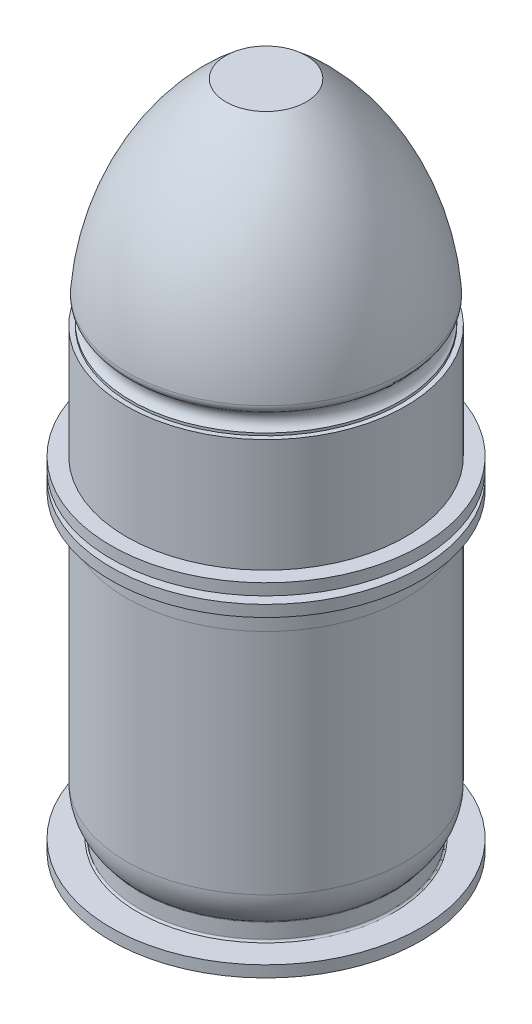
ISO-10303-21;
HEADER;
FILE_DESCRIPTION(('STEP AP214'),'2;1');
FILE_NAME('part.step','',(''),(''),'','','');
FILE_SCHEMA(('AUTOMOTIVE_DESIGN { 1 0 10303 214 1 1 1 1 }'));
ENDSEC;
DATA;
#1=APPLICATION_CONTEXT('core data for automotive mechanical design processes');
#2=APPLICATION_PROTOCOL_DEFINITION('international standard','automotive_design',2000,#1);
#3=PRODUCT_CONTEXT('',#1,'mechanical');
#4=PRODUCT('Part','Part','',(#3));
#5=PRODUCT_RELATED_PRODUCT_CATEGORY('part','',(#4));
#6=PRODUCT_DEFINITION_FORMATION('','',#4);
#7=PRODUCT_DEFINITION_CONTEXT('part definition',#1,'design');
#8=PRODUCT_DEFINITION('design','',#6,#7);
#9=PRODUCT_DEFINITION_SHAPE('','',#8);
#10=(LENGTH_UNIT() NAMED_UNIT(*) SI_UNIT(.MILLI.,.METRE.));
#11=(NAMED_UNIT(*) PLANE_ANGLE_UNIT() SI_UNIT($,.RADIAN.));
#12=(NAMED_UNIT(*) SI_UNIT($,.STERADIAN.) SOLID_ANGLE_UNIT());
#13=UNCERTAINTY_MEASURE_WITH_UNIT(LENGTH_MEASURE(1.E-05),#10,'distance_accuracy_value','');
#14=(GEOMETRIC_REPRESENTATION_CONTEXT(3) GLOBAL_UNCERTAINTY_ASSIGNED_CONTEXT((#13)) GLOBAL_UNIT_ASSIGNED_CONTEXT((#10,
#11,#12)) REPRESENTATION_CONTEXT('',''));
#15=CARTESIAN_POINT('',(0.,0.,0.));
#16=DIRECTION('',(0.,0.,1.));
#17=DIRECTION('',(1.,0.,0.));
#18=AXIS2_PLACEMENT_3D('',#15,#16,#17);
#19=CARTESIAN_POINT('',(0.,0.,0.));
#20=DIRECTION('',(0.,-1.,0.));
#21=DIRECTION('',(0.,0.,-1.));
#22=AXIS2_PLACEMENT_3D('',#19,#20,#21);
#23=PLANE('',#22);
#24=CARTESIAN_POINT('',(0.,0.,0.));
#25=DIRECTION('',(0.,-1.,0.));
#26=DIRECTION('',(0.,0.,-1.));
#27=AXIS2_PLACEMENT_3D('',#24,#25,#26);
#28=CIRCLE('',#27,1.9177);
#29=CARTESIAN_POINT('',(0.,0.,-1.9177));
#30=VERTEX_POINT('',#29);
#31=EDGE_CURVE('E68',#30,#30,#28,.T.);
#32=ORIENTED_EDGE('',*,*,#31,.T.);
#33=EDGE_LOOP('',(#32));
#34=FACE_BOUND('',#33,.T.);
#35=ADVANCED_FACE('F46',(#34),#23,.T.);
#36=CARTESIAN_POINT('',(0.,2.3622,0.));
#37=DIRECTION('',(0.,1.,0.));
#38=DIRECTION('',(0.,0.,1.));
#39=AXIS2_PLACEMENT_3D('',#36,#37,#38);
#40=PLANE('',#39);
#41=CARTESIAN_POINT('',(0.,2.3622,0.));
#42=DIRECTION('',(0.,-1.,0.));
#43=DIRECTION('',(0.,0.,-1.));
#44=AXIS2_PLACEMENT_3D('',#41,#42,#43);
#45=CIRCLE('',#44,1.9177);
#46=CARTESIAN_POINT('',(0.,2.3622,-1.9177));
#47=VERTEX_POINT('',#46);
#48=EDGE_CURVE('E11',#47,#47,#45,.T.);
#49=ORIENTED_EDGE('',*,*,#48,.F.);
#50=EDGE_LOOP('',(#49));
#51=FACE_BOUND('',#50,.T.);
#52=ADVANCED_FACE('F85',(#51),#40,.T.);
#53=CARTESIAN_POINT('',(0.,0.,0.));
#54=DIRECTION('',(0.,-1.,0.));
#55=DIRECTION('',(0.,0.,-1.));
#56=AXIS2_PLACEMENT_3D('',#53,#54,#55);
#57=CYLINDRICAL_SURFACE('',#56,1.9177);
#58=ORIENTED_EDGE('',*,*,#48,.T.);
#59=EDGE_LOOP('',(#58));
#60=FACE_BOUND('',#59,.T.);
#61=CARTESIAN_POINT('',(0.,1.75229833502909,0.));
#62=DIRECTION('',(0.,-1.,0.));
#63=DIRECTION('',(0.,0.,-1.));
#64=AXIS2_PLACEMENT_3D('',#61,#62,#63);
#65=CIRCLE('',#64,1.9177);
#66=CARTESIAN_POINT('',(0.,1.75229833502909,-1.9177));
#67=VERTEX_POINT('',#66);
#68=EDGE_CURVE('E52',#67,#67,#65,.T.);
#69=ORIENTED_EDGE('',*,*,#68,.F.);
#70=EDGE_LOOP('',(#69));
#71=FACE_BOUND('',#70,.T.);
#72=ADVANCED_FACE('F89',(#60,#71),#57,.T.);
#73=CARTESIAN_POINT('',(0.,1.75229833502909,0.));
#74=DIRECTION('',(0.,-1.,0.));
#75=DIRECTION('',(0.,0.,-1.));
#76=AXIS2_PLACEMENT_3D('',#73,#74,#75);
#77=PLANE('',#76);
#78=ORIENTED_EDGE('',*,*,#68,.T.);
#79=EDGE_LOOP('',(#78));
#80=FACE_BOUND('',#79,.T.);
#81=CARTESIAN_POINT('',(0.,1.75229833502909,0.));
#82=DIRECTION('',(0.,-1.,0.));
#83=DIRECTION('',(0.,0.,-1.));
#84=AXIS2_PLACEMENT_3D('',#81,#82,#83);
#85=CIRCLE('',#84,1.651);
#86=CARTESIAN_POINT('',(0.,1.75229833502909,-1.651));
#87=VERTEX_POINT('',#86);
#88=EDGE_CURVE('E56',#87,#87,#85,.T.);
#89=ORIENTED_EDGE('',*,*,#88,.F.);
#90=EDGE_LOOP('',(#89));
#91=FACE_BOUND('',#90,.T.);
#92=ADVANCED_FACE('F94',(#80,#91),#77,.T.);
#93=CARTESIAN_POINT('',(0.,0.,0.));
#94=DIRECTION('',(0.,-1.,0.));
#95=DIRECTION('',(0.,0.,-1.));
#96=AXIS2_PLACEMENT_3D('',#93,#94,#95);
#97=CYLINDRICAL_SURFACE('',#96,1.651);
#98=ORIENTED_EDGE('',*,*,#88,.T.);
#99=EDGE_LOOP('',(#98));
#100=FACE_BOUND('',#99,.T.);
#101=CARTESIAN_POINT('',(0.,0.990298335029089,0.));
#102=DIRECTION('',(0.,-1.,0.));
#103=DIRECTION('',(0.,0.,-1.));
#104=AXIS2_PLACEMENT_3D('',#101,#102,#103);
#105=CIRCLE('',#104,1.651);
#106=CARTESIAN_POINT('',(0.,0.990298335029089,-1.651));
#107=VERTEX_POINT('',#106);
#108=EDGE_CURVE('E60',#107,#107,#105,.T.);
#109=ORIENTED_EDGE('',*,*,#108,.F.);
#110=EDGE_LOOP('',(#109));
#111=FACE_BOUND('',#110,.T.);
#112=ADVANCED_FACE('F81',(#100,#111),#97,.T.);
#113=CARTESIAN_POINT('',(0.,1.016,0.));
#114=DIRECTION('',(0.,1.,0.));
#115=DIRECTION('',(0.,0.,1.));
#116=AXIS2_PLACEMENT_3D('',#113,#114,#115);
#117=CONICAL_SURFACE('',#116,1.9177,1.47472380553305);
#118=ORIENTED_EDGE('',*,*,#108,.T.);
#119=EDGE_LOOP('',(#118));
#120=FACE_BOUND('',#119,.T.);
#121=CARTESIAN_POINT('',(0.,1.016,0.));
#122=DIRECTION('',(0.,-1.,0.));
#123=DIRECTION('',(0.,0.,-1.));
#124=AXIS2_PLACEMENT_3D('',#121,#122,#123);
#125=CIRCLE('',#124,1.9177);
#126=CARTESIAN_POINT('',(0.,1.016,-1.9177));
#127=VERTEX_POINT('',#126);
#128=EDGE_CURVE('E65',#127,#127,#125,.T.);
#129=ORIENTED_EDGE('',*,*,#128,.F.);
#130=EDGE_LOOP('',(#129));
#131=FACE_BOUND('',#130,.T.);
#132=ADVANCED_FACE('F75',(#120,#131),#117,.F.);
#133=CARTESIAN_POINT('',(0.,0.,0.));
#134=DIRECTION('',(0.,-1.,0.));
#135=DIRECTION('',(0.,0.,-1.));
#136=AXIS2_PLACEMENT_3D('',#133,#134,#135);
#137=CYLINDRICAL_SURFACE('',#136,1.9177);
#138=ORIENTED_EDGE('',*,*,#128,.T.);
#139=EDGE_LOOP('',(#138));
#140=FACE_BOUND('',#139,.T.);
#141=ORIENTED_EDGE('',*,*,#31,.F.);
#142=EDGE_LOOP('',(#141));
#143=FACE_BOUND('',#142,.T.);
#144=ADVANCED_FACE('F73',(#140,#143),#137,.T.);
#145=CLOSED_SHELL('',(#35,#52,#72,#92,#112,#132,#144));
#146=MANIFOLD_SOLID_BREP('B2',#145);
#147=CARTESIAN_POINT('',(0.,0.,0.));
#148=DIRECTION('',(0.,-1.,0.));
#149=DIRECTION('',(0.,0.,-1.));
#150=AXIS2_PLACEMENT_3D('',#147,#148,#149);
#151=CYLINDRICAL_SURFACE('',#150,1.143);
#152=CARTESIAN_POINT('',(0.,5.08,0.));
#153=DIRECTION('',(0.,-1.,0.));
#154=DIRECTION('',(0.,0.,-1.));
#155=AXIS2_PLACEMENT_3D('',#152,#153,#154);
#156=CIRCLE('',#155,1.143);
#157=CARTESIAN_POINT('',(0.,5.08,1.143));
#158=VERTEX_POINT('',#157);
#159=EDGE_CURVE('E45',#158,#158,#156,.T.);
#160=ORIENTED_EDGE('',*,*,#159,.F.);
#161=EDGE_LOOP('',(#160));
#162=FACE_BOUND('',#161,.T.);
#163=CARTESIAN_POINT('',(0.,3.81,0.));
#164=DIRECTION('',(0.,-1.,0.));
#165=DIRECTION('',(0.,0.,-1.));
#166=AXIS2_PLACEMENT_3D('',#163,#164,#165);
#167=CIRCLE('',#166,1.143);
#168=CARTESIAN_POINT('',(0.,3.81,-1.143));
#169=VERTEX_POINT('',#168);
#170=EDGE_CURVE('E204',#169,#169,#167,.T.);
#171=ORIENTED_EDGE('',*,*,#170,.T.);
#172=EDGE_LOOP('',(#171));
#173=FACE_BOUND('',#172,.T.);
#174=ADVANCED_FACE('F158',(#162,#173),#151,.F.);
#175=CARTESIAN_POINT('',(0.,5.08,0.));
#176=DIRECTION('',(0.,1.,0.));
#177=DIRECTION('',(0.,0.,1.));
#178=AXIS2_PLACEMENT_3D('',#175,#176,#177);
#179=CONICAL_SURFACE('',#178,1.143,1.30899693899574);
#180=CARTESIAN_POINT('',(0.,6.30506370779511,0.));
#181=DIRECTION('',(0.,-1.,0.));
#182=DIRECTION('',(0.,0.,-1.));
#183=AXIS2_PLACEMENT_3D('',#180,#181,#182);
#184=CIRCLE('',#183,5.715);
#185=CARTESIAN_POINT('',(0.,6.30506370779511,5.715));
#186=VERTEX_POINT('',#185);
#187=EDGE_CURVE('E164',#186,#186,#184,.T.);
#188=CARTESIAN_POINT('',(0.,6.30506370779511,5.715));
#189=CARTESIAN_POINT('',(0.,6.29230262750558,5.667375));
#190=CARTESIAN_POINT('',(0.,6.27954154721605,5.61975));
#191=CARTESIAN_POINT('',(0.,6.25401938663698,5.5245));
#192=CARTESIAN_POINT('',(0.,6.24125830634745,5.476875));
#193=CARTESIAN_POINT('',(0.,6.21573614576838,5.381625));
#194=CARTESIAN_POINT('',(0.,6.20297506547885,5.334));
#195=CARTESIAN_POINT('',(0.,6.17745290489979,5.23875));
#196=CARTESIAN_POINT('',(0.,6.16469182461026,5.191125));
#197=CARTESIAN_POINT('',(0.,6.13916966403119,5.095875));
#198=CARTESIAN_POINT('',(0.,6.12640858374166,5.04825));
#199=CARTESIAN_POINT('',(0.,6.10088642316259,4.953));
#200=CARTESIAN_POINT('',(0.,6.08812534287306,4.905375));
#201=CARTESIAN_POINT('',(0.,6.062603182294,4.810125));
#202=CARTESIAN_POINT('',(0.,6.04984210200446,4.7625));
#203=CARTESIAN_POINT('',(0.,6.0243199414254,4.66725));
#204=CARTESIAN_POINT('',(0.,6.01155886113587,4.619625));
#205=CARTESIAN_POINT('',(0.,5.9860367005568,4.524375));
#206=CARTESIAN_POINT('',(0.,5.97327562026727,4.47675));
#207=CARTESIAN_POINT('',(0.,5.9477534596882,4.3815));
#208=CARTESIAN_POINT('',(0.,5.93499237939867,4.333875));
#209=CARTESIAN_POINT('',(0.,5.90947021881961,4.238625));
#210=CARTESIAN_POINT('',(0.,5.89670913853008,4.191));
#211=CARTESIAN_POINT('',(0.,5.87118697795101,4.09575));
#212=CARTESIAN_POINT('',(0.,5.85842589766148,4.048125));
#213=CARTESIAN_POINT('',(0.,5.83290373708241,3.952875));
#214=CARTESIAN_POINT('',(0.,5.82014265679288,3.90525));
#215=CARTESIAN_POINT('',(0.,5.79462049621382,3.81));
#216=CARTESIAN_POINT('',(0.,5.78185941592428,3.762375));
#217=CARTESIAN_POINT('',(0.,5.75633725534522,3.667125));
#218=CARTESIAN_POINT('',(0.,5.74357617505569,3.6195));
#219=CARTESIAN_POINT('',(0.,5.71805401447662,3.52425));
#220=CARTESIAN_POINT('',(0.,5.70529293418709,3.476625));
#221=CARTESIAN_POINT('',(0.,5.67977077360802,3.381375));
#222=CARTESIAN_POINT('',(0.,5.66700969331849,3.33375));
#223=CARTESIAN_POINT('',(0.,5.64148753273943,3.2385));
#224=CARTESIAN_POINT('',(0.,5.62872645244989,3.190875));
#225=CARTESIAN_POINT('',(0.,5.60320429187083,3.095625));
#226=CARTESIAN_POINT('',(0.,5.5904432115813,3.048));
#227=CARTESIAN_POINT('',(0.,5.56492105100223,2.95275));
#228=CARTESIAN_POINT('',(0.,5.5521599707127,2.905125));
#229=CARTESIAN_POINT('',(0.,5.52663781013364,2.809875));
#230=CARTESIAN_POINT('',(0.,5.5138767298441,2.76225));
#231=CARTESIAN_POINT('',(0.,5.48835456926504,2.667));
#232=CARTESIAN_POINT('',(0.,5.47559348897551,2.619375));
#233=CARTESIAN_POINT('',(0.,5.45007132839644,2.524125));
#234=CARTESIAN_POINT('',(0.,5.43731024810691,2.4765));
#235=CARTESIAN_POINT('',(0.,5.41178808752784,2.38125));
#236=CARTESIAN_POINT('',(0.,5.39902700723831,2.333625));
#237=CARTESIAN_POINT('',(0.,5.37350484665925,2.238375));
#238=CARTESIAN_POINT('',(0.,5.36074376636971,2.19075));
#239=CARTESIAN_POINT('',(0.,5.33522160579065,2.0955));
#240=CARTESIAN_POINT('',(0.,5.32246052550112,2.047875));
#241=CARTESIAN_POINT('',(0.,5.29693836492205,1.952625));
#242=CARTESIAN_POINT('',(0.,5.28417728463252,1.905));
#243=CARTESIAN_POINT('',(0.,5.25865512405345,1.80975));
#244=CARTESIAN_POINT('',(0.,5.24589404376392,1.762125));
#245=CARTESIAN_POINT('',(0.,5.22037188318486,1.666875));
#246=CARTESIAN_POINT('',(0.,5.20761080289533,1.61925));
#247=CARTESIAN_POINT('',(0.,5.18208864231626,1.524));
#248=CARTESIAN_POINT('',(0.,5.16932756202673,1.476375));
#249=CARTESIAN_POINT('',(0.,5.14380540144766,1.381125));
#250=CARTESIAN_POINT('',(0.,5.13104432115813,1.3335));
#251=CARTESIAN_POINT('',(0.,5.10552216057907,1.23825));
#252=CARTESIAN_POINT('',(0.,5.09276108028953,1.190625));
#253=CARTESIAN_POINT('',(0.,5.08,1.143));
#254=B_SPLINE_CURVE_WITH_KNOTS('',3,(#188,#189,#190,#191,#192,#193,#194,#195,#196,#197,#198,
#199,#200,#201,#202,#203,#204,#205,#206,#207,#208,#209,#210,#211,#212,#213,#214,#215,#216,#217,
#218,#219,#220,#221,#222,#223,#224,#225,#226,#227,#228,#229,#230,#231,#232,#233,#234,#235,#236,
#237,#238,#239,#240,#241,#242,#243,#244,#245,#246,#247,#248,#249,#250,#251,#252,#253),
.UNSPECIFIED.,.F.,.F.,(4,2,2,2,2,2,2,2,2,2,2,2,2,2,2,2,2,2,2,2,2,2,2,2,2,2,2,2,2,2,2,2,4),(0.,
0.147915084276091,0.295830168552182,0.443745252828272,0.591660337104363,0.739575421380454,
0.887490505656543,1.03540558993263,1.18332067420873,1.33123575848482,1.47915084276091,
1.627065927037,1.77498101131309,1.92289609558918,2.07081117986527,2.21872626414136,
2.36664134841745,2.51455643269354,2.66247151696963,2.81038660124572,2.95830168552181,
3.10621676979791,3.254131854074,3.40204693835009,3.54996202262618,3.69787710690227,
3.84579219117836,3.99370727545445,4.14162235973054,4.28953744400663,4.43745252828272,
4.58536761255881,4.7332826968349),.UNSPECIFIED.);
#255=EDGE_CURVE('BSEAM277',#186,#158,#254,.T.);
#256=ORIENTED_EDGE('',*,*,#187,.F.);
#257=ORIENTED_EDGE('',*,*,#159,.T.);
#258=ORIENTED_EDGE('',*,*,#255,.T.);
#259=ORIENTED_EDGE('',*,*,#255,.F.);
#260=EDGE_LOOP('',(#256,#258,#257,#259));
#261=FACE_BOUND('',#260,.T.);
#262=ADVANCED_FACE('F277',(#261),#179,.F.);
#263=CARTESIAN_POINT('',(0.,0.,0.));
#264=DIRECTION('',(0.,-1.,0.));
#265=DIRECTION('',(0.,0.,-1.));
#266=AXIS2_PLACEMENT_3D('',#263,#264,#265);
#267=CYLINDRICAL_SURFACE('',#266,5.715);
#268=CARTESIAN_POINT('',(0.,4.826,0.));
#269=DIRECTION('',(0.,-1.,0.));
#270=DIRECTION('',(0.,0.,-1.));
#271=AXIS2_PLACEMENT_3D('',#268,#269,#270);
#272=CIRCLE('',#271,5.715);
#273=CARTESIAN_POINT('',(0.,4.826,-5.715));
#274=VERTEX_POINT('',#273);
#275=EDGE_CURVE('E168',#274,#274,#272,.T.);
#276=ORIENTED_EDGE('',*,*,#275,.F.);
#277=EDGE_LOOP('',(#276));
#278=FACE_BOUND('',#277,.T.);
#279=ORIENTED_EDGE('',*,*,#187,.T.);
#280=EDGE_LOOP('',(#279));
#281=FACE_BOUND('',#280,.T.);
#282=ADVANCED_FACE('F272',(#278,#281),#267,.T.);
#283=CARTESIAN_POINT('',(0.,4.826,0.));
#284=DIRECTION('',(0.,-1.,0.));
#285=DIRECTION('',(0.,0.,-1.));
#286=AXIS2_PLACEMENT_3D('',#283,#284,#285);
#287=PLANE('',#286);
#288=CARTESIAN_POINT('',(0.,4.826,0.));
#289=DIRECTION('',(0.,-1.,0.));
#290=DIRECTION('',(0.,0.,-1.));
#291=AXIS2_PLACEMENT_3D('',#288,#289,#290);
#292=CIRCLE('',#291,6.096);
#293=CARTESIAN_POINT('',(0.,4.826,-6.096));
#294=VERTEX_POINT('',#293);
#295=EDGE_CURVE('E172',#294,#294,#292,.T.);
#296=ORIENTED_EDGE('',*,*,#295,.F.);
#297=EDGE_LOOP('',(#296));
#298=FACE_BOUND('',#297,.T.);
#299=ORIENTED_EDGE('',*,*,#275,.T.);
#300=EDGE_LOOP('',(#299));
#301=FACE_BOUND('',#300,.T.);
#302=ADVANCED_FACE('F266',(#298,#301),#287,.F.);
#303=CARTESIAN_POINT('',(0.,0.,0.));
#304=DIRECTION('',(0.,-1.,0.));
#305=DIRECTION('',(0.,0.,-1.));
#306=AXIS2_PLACEMENT_3D('',#303,#304,#305);
#307=CYLINDRICAL_SURFACE('',#306,6.096);
#308=CARTESIAN_POINT('',(0.,2.286,0.));
#309=DIRECTION('',(0.,-1.,0.));
#310=DIRECTION('',(0.,0.,-1.));
#311=AXIS2_PLACEMENT_3D('',#308,#309,#310);
#312=CIRCLE('',#311,6.096);
#313=CARTESIAN_POINT('',(0.,2.286,-6.096));
#314=VERTEX_POINT('',#313);
#315=EDGE_CURVE('E177',#314,#314,#312,.T.);
#316=ORIENTED_EDGE('',*,*,#315,.F.);
#317=EDGE_LOOP('',(#316));
#318=FACE_BOUND('',#317,.T.);
#319=ORIENTED_EDGE('',*,*,#295,.T.);
#320=EDGE_LOOP('',(#319));
#321=FACE_BOUND('',#320,.T.);
#322=ADVANCED_FACE('F260',(#318,#321),#307,.T.);
#323=CARTESIAN_POINT('',(0.,2.286,0.));
#324=DIRECTION('',(0.,1.,0.));
#325=DIRECTION('',(0.,0.,1.));
#326=AXIS2_PLACEMENT_3D('',#323,#324,#325);
#327=PLANE('',#326);
#328=CARTESIAN_POINT('',(0.,2.286,0.));
#329=DIRECTION('',(0.,-1.,0.));
#330=DIRECTION('',(0.,0.,-1.));
#331=AXIS2_PLACEMENT_3D('',#328,#329,#330);
#332=CIRCLE('',#331,5.715);
#333=CARTESIAN_POINT('',(0.,2.286,-5.715));
#334=VERTEX_POINT('',#333);
#335=EDGE_CURVE('E180',#334,#334,#332,.T.);
#336=ORIENTED_EDGE('',*,*,#335,.F.);
#337=EDGE_LOOP('',(#336));
#338=FACE_BOUND('',#337,.T.);
#339=ORIENTED_EDGE('',*,*,#315,.T.);
#340=EDGE_LOOP('',(#339));
#341=FACE_BOUND('',#340,.T.);
#342=ADVANCED_FACE('F254',(#338,#341),#327,.F.);
#343=CARTESIAN_POINT('',(0.,0.,0.));
#344=DIRECTION('',(0.,-1.,0.));
#345=DIRECTION('',(0.,0.,-1.));
#346=AXIS2_PLACEMENT_3D('',#343,#344,#345);
#347=CYLINDRICAL_SURFACE('',#346,5.715);
#348=CARTESIAN_POINT('',(0.,0.,0.));
#349=DIRECTION('',(0.,-1.,0.));
#350=DIRECTION('',(0.,0.,-1.));
#351=AXIS2_PLACEMENT_3D('',#348,#349,#350);
#352=CIRCLE('',#351,5.715);
#353=CARTESIAN_POINT('',(0.,0.,-5.715));
#354=VERTEX_POINT('',#353);
#355=EDGE_CURVE('E183',#354,#354,#352,.T.);
#356=ORIENTED_EDGE('',*,*,#355,.F.);
#357=EDGE_LOOP('',(#356));
#358=FACE_BOUND('',#357,.T.);
#359=ORIENTED_EDGE('',*,*,#335,.T.);
#360=EDGE_LOOP('',(#359));
#361=FACE_BOUND('',#360,.T.);
#362=ADVANCED_FACE('F248',(#358,#361),#347,.T.);
#363=CARTESIAN_POINT('',(0.,0.,0.));
#364=DIRECTION('',(0.,1.,0.));
#365=DIRECTION('',(0.,0.,1.));
#366=AXIS2_PLACEMENT_3D('',#363,#364,#365);
#367=PLANE('',#366);
#368=CARTESIAN_POINT('',(0.,0.,0.));
#369=DIRECTION('',(0.,-1.,0.));
#370=DIRECTION('',(0.,0.,-1.));
#371=AXIS2_PLACEMENT_3D('',#368,#369,#370);
#372=CIRCLE('',#371,1.9177);
#373=CARTESIAN_POINT('',(0.,0.,-1.9177));
#374=VERTEX_POINT('',#373);
#375=EDGE_CURVE('E186',#374,#374,#372,.T.);
#376=ORIENTED_EDGE('',*,*,#375,.F.);
#377=EDGE_LOOP('',(#376));
#378=FACE_BOUND('',#377,.T.);
#379=ORIENTED_EDGE('',*,*,#355,.T.);
#380=EDGE_LOOP('',(#379));
#381=FACE_BOUND('',#380,.T.);
#382=ADVANCED_FACE('F242',(#378,#381),#367,.F.);
#383=CARTESIAN_POINT('',(0.,0.,0.));
#384=DIRECTION('',(0.,-1.,0.));
#385=DIRECTION('',(0.,0.,-1.));
#386=AXIS2_PLACEMENT_3D('',#383,#384,#385);
#387=CYLINDRICAL_SURFACE('',#386,1.9177);
#388=CARTESIAN_POINT('',(0.,1.016,0.));
#389=DIRECTION('',(0.,-1.,0.));
#390=DIRECTION('',(0.,0.,-1.));
#391=AXIS2_PLACEMENT_3D('',#388,#389,#390);
#392=CIRCLE('',#391,1.9177);
#393=CARTESIAN_POINT('',(0.,1.016,-1.9177));
#394=VERTEX_POINT('',#393);
#395=EDGE_CURVE('E189',#394,#394,#392,.T.);
#396=ORIENTED_EDGE('',*,*,#395,.F.);
#397=EDGE_LOOP('',(#396));
#398=FACE_BOUND('',#397,.T.);
#399=ORIENTED_EDGE('',*,*,#375,.T.);
#400=EDGE_LOOP('',(#399));
#401=FACE_BOUND('',#400,.T.);
#402=ADVANCED_FACE('F236',(#398,#401),#387,.F.);
#403=CARTESIAN_POINT('',(0.,1.016,0.));
#404=DIRECTION('',(0.,1.,0.));
#405=DIRECTION('',(0.,0.,1.));
#406=AXIS2_PLACEMENT_3D('',#403,#404,#405);
#407=CONICAL_SURFACE('',#406,1.9177,1.47472380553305);
#408=CARTESIAN_POINT('',(0.,0.990298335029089,0.));
#409=DIRECTION('',(0.,-1.,0.));
#410=DIRECTION('',(0.,0.,-1.));
#411=AXIS2_PLACEMENT_3D('',#408,#409,#410);
#412=CIRCLE('',#411,1.651);
#413=CARTESIAN_POINT('',(0.,0.990298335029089,-1.651));
#414=VERTEX_POINT('',#413);
#415=EDGE_CURVE('E192',#414,#414,#412,.T.);
#416=ORIENTED_EDGE('',*,*,#415,.F.);
#417=EDGE_LOOP('',(#416));
#418=FACE_BOUND('',#417,.T.);
#419=ORIENTED_EDGE('',*,*,#395,.T.);
#420=EDGE_LOOP('',(#419));
#421=FACE_BOUND('',#420,.T.);
#422=ADVANCED_FACE('F230',(#418,#421),#407,.T.);
#423=CARTESIAN_POINT('',(0.,0.,0.));
#424=DIRECTION('',(0.,-1.,0.));
#425=DIRECTION('',(0.,0.,-1.));
#426=AXIS2_PLACEMENT_3D('',#423,#424,#425);
#427=CYLINDRICAL_SURFACE('',#426,1.651);
#428=CARTESIAN_POINT('',(0.,1.75229833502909,0.));
#429=DIRECTION('',(0.,-1.,0.));
#430=DIRECTION('',(0.,0.,-1.));
#431=AXIS2_PLACEMENT_3D('',#428,#429,#430);
#432=CIRCLE('',#431,1.651);
#433=CARTESIAN_POINT('',(0.,1.75229833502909,-1.651));
#434=VERTEX_POINT('',#433);
#435=EDGE_CURVE('E195',#434,#434,#432,.T.);
#436=ORIENTED_EDGE('',*,*,#435,.F.);
#437=EDGE_LOOP('',(#436));
#438=FACE_BOUND('',#437,.T.);
#439=ORIENTED_EDGE('',*,*,#415,.T.);
#440=EDGE_LOOP('',(#439));
#441=FACE_BOUND('',#440,.T.);
#442=ADVANCED_FACE('F224',(#438,#441),#427,.F.);
#443=CARTESIAN_POINT('',(0.,1.75229833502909,0.));
#444=DIRECTION('',(0.,-1.,0.));
#445=DIRECTION('',(0.,0.,-1.));
#446=AXIS2_PLACEMENT_3D('',#443,#444,#445);
#447=PLANE('',#446);
#448=CARTESIAN_POINT('',(0.,1.75229833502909,0.));
#449=DIRECTION('',(0.,-1.,0.));
#450=DIRECTION('',(0.,0.,-1.));
#451=AXIS2_PLACEMENT_3D('',#448,#449,#450);
#452=CIRCLE('',#451,1.9177);
#453=CARTESIAN_POINT('',(0.,1.75229833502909,-1.9177));
#454=VERTEX_POINT('',#453);
#455=EDGE_CURVE('E198',#454,#454,#452,.T.);
#456=ORIENTED_EDGE('',*,*,#455,.F.);
#457=EDGE_LOOP('',(#456));
#458=FACE_BOUND('',#457,.T.);
#459=ORIENTED_EDGE('',*,*,#435,.T.);
#460=EDGE_LOOP('',(#459));
#461=FACE_BOUND('',#460,.T.);
#462=ADVANCED_FACE('F218',(#458,#461),#447,.F.);
#463=CARTESIAN_POINT('',(0.,0.,0.));
#464=DIRECTION('',(0.,-1.,0.));
#465=DIRECTION('',(0.,0.,-1.));
#466=AXIS2_PLACEMENT_3D('',#463,#464,#465);
#467=CYLINDRICAL_SURFACE('',#466,1.9177);
#468=CARTESIAN_POINT('',(0.,3.0353,0.));
#469=DIRECTION('',(0.,-1.,0.));
#470=DIRECTION('',(0.,0.,-1.));
#471=AXIS2_PLACEMENT_3D('',#468,#469,#470);
#472=CIRCLE('',#471,1.9177);
#473=CARTESIAN_POINT('',(0.,3.0353,-1.9177));
#474=VERTEX_POINT('',#473);
#475=EDGE_CURVE('E201',#474,#474,#472,.T.);
#476=ORIENTED_EDGE('',*,*,#475,.F.);
#477=EDGE_LOOP('',(#476));
#478=FACE_BOUND('',#477,.T.);
#479=ORIENTED_EDGE('',*,*,#455,.T.);
#480=EDGE_LOOP('',(#479));
#481=FACE_BOUND('',#480,.T.);
#482=ADVANCED_FACE('F212',(#478,#481),#467,.F.);
#483=CARTESIAN_POINT('',(0.,3.0353,0.));
#484=DIRECTION('',(0.,-1.,0.));
#485=DIRECTION('',(0.,0.,-1.));
#486=AXIS2_PLACEMENT_3D('',#483,#484,#485);
#487=CONICAL_SURFACE('',#486,1.9177,0.78539816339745);
#488=ORIENTED_EDGE('',*,*,#170,.F.);
#489=EDGE_LOOP('',(#488));
#490=FACE_BOUND('',#489,.T.);
#491=ORIENTED_EDGE('',*,*,#475,.T.);
#492=EDGE_LOOP('',(#491));
#493=FACE_BOUND('',#492,.T.);
#494=ADVANCED_FACE('F209',(#490,#493),#487,.F.);
#495=CLOSED_SHELL('',(#174,#262,#282,#302,#322,#342,#362,#382,#402,#422,#442,#462,#482,#494));
#496=MANIFOLD_SOLID_BREP('B6',#495);
#497=CARTESIAN_POINT('',(0.,15.875,0.));
#498=DIRECTION('',(0.,-1.,0.));
#499=DIRECTION('',(1.,0.,0.));
#500=AXIS2_PLACEMENT_3D('',#497,#498,#499);
#501=PLANE('',#500);
#502=CARTESIAN_POINT('',(0.,15.875,0.));
#503=DIRECTION('',(0.,-1.,0.));
#504=DIRECTION('',(1.,0.,0.));
#505=AXIS2_PLACEMENT_3D('',#502,#503,#504);
#506=CIRCLE('',#505,4.95299999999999);
#507=CARTESIAN_POINT('',(4.95299999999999,15.875,0.));
#508=VERTEX_POINT('',#507);
#509=EDGE_CURVE('E157',#508,#508,#506,.T.);
#510=ORIENTED_EDGE('',*,*,#509,.F.);
#511=EDGE_LOOP('',(#510));
#512=FACE_BOUND('',#511,.T.);
#513=ADVANCED_FACE('F379',(#512),#501,.F.);
#514=CARTESIAN_POINT('',(0.,15.113,0.));
#515=DIRECTION('',(0.,-1.,0.));
#516=DIRECTION('',(1.,0.,0.));
#517=AXIS2_PLACEMENT_3D('',#514,#515,#516);
#518=TOROIDAL_SURFACE('',#517,4.953,0.762000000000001);
#519=CARTESIAN_POINT('',(0.,15.113,0.));
#520=DIRECTION('',(0.,-1.,0.));
#521=DIRECTION('',(1.,0.,0.));
#522=AXIS2_PLACEMENT_3D('',#519,#520,#521);
#523=CIRCLE('',#522,5.715);
#524=CARTESIAN_POINT('',(5.715,15.113,0.));
#525=VERTEX_POINT('',#524);
#526=EDGE_CURVE('E385',#525,#525,#523,.T.);
#527=ORIENTED_EDGE('',*,*,#526,.F.);
#528=EDGE_LOOP('',(#527));
#529=FACE_BOUND('',#528,.T.);
#530=ORIENTED_EDGE('',*,*,#509,.T.);
#531=EDGE_LOOP('',(#530));
#532=FACE_BOUND('',#531,.T.);
#533=ADVANCED_FACE('F424',(#529,#532),#518,.T.);
#534=CARTESIAN_POINT('',(0.,0.,0.));
#535=DIRECTION('',(0.,-1.,0.));
#536=DIRECTION('',(1.,0.,0.));
#537=AXIS2_PLACEMENT_3D('',#534,#535,#536);
#538=CYLINDRICAL_SURFACE('',#537,5.715);
#539=CARTESIAN_POINT('',(0.,6.30506370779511,0.));
#540=DIRECTION('',(0.,-1.,0.));
#541=DIRECTION('',(1.,0.,0.));
#542=AXIS2_PLACEMENT_3D('',#539,#540,#541);
#543=CIRCLE('',#542,5.715);
#544=CARTESIAN_POINT('',(-5.715,6.30506370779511,0.));
#545=VERTEX_POINT('',#544);
#546=EDGE_CURVE('E389',#545,#545,#543,.T.);
#547=ORIENTED_EDGE('',*,*,#546,.F.);
#548=EDGE_LOOP('',(#547));
#549=FACE_BOUND('',#548,.T.);
#550=ORIENTED_EDGE('',*,*,#526,.T.);
#551=EDGE_LOOP('',(#550));
#552=FACE_BOUND('',#551,.T.);
#553=ADVANCED_FACE('F429',(#549,#552),#538,.T.);
#554=CARTESIAN_POINT('',(0.,5.08,0.));
#555=DIRECTION('',(0.,1.,0.));
#556=DIRECTION('',(-1.,0.,0.));
#557=AXIS2_PLACEMENT_3D('',#554,#555,#556);
#558=CONICAL_SURFACE('',#557,1.143,1.30899693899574);
#559=CARTESIAN_POINT('',(0.,5.08,0.));
#560=DIRECTION('',(0.,-1.,0.));
#561=DIRECTION('',(1.,0.,0.));
#562=AXIS2_PLACEMENT_3D('',#559,#560,#561);
#563=CIRCLE('',#562,1.143);
#564=CARTESIAN_POINT('',(-1.143,5.08,0.));
#565=VERTEX_POINT('',#564);
#566=EDGE_CURVE('E393',#565,#565,#563,.T.);
#567=CARTESIAN_POINT('',(-5.715,6.30506370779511,0.));
#568=CARTESIAN_POINT('',(-5.667375,6.29230262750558,0.));
#569=CARTESIAN_POINT('',(-5.61975,6.27954154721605,0.));
#570=CARTESIAN_POINT('',(-5.5245,6.25401938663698,0.));
#571=CARTESIAN_POINT('',(-5.476875,6.24125830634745,0.));
#572=CARTESIAN_POINT('',(-5.381625,6.21573614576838,0.));
#573=CARTESIAN_POINT('',(-5.334,6.20297506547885,0.));
#574=CARTESIAN_POINT('',(-5.23875,6.17745290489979,0.));
#575=CARTESIAN_POINT('',(-5.191125,6.16469182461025,0.));
#576=CARTESIAN_POINT('',(-5.095875,6.13916966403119,0.));
#577=CARTESIAN_POINT('',(-5.04825,6.12640858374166,0.));
#578=CARTESIAN_POINT('',(-4.953,6.10088642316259,0.));
#579=CARTESIAN_POINT('',(-4.905375,6.08812534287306,0.));
#580=CARTESIAN_POINT('',(-4.810125,6.06260318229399,0.));
#581=CARTESIAN_POINT('',(-4.7625,6.04984210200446,0.));
#582=CARTESIAN_POINT('',(-4.66725,6.0243199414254,0.));
#583=CARTESIAN_POINT('',(-4.619625,6.01155886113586,0.));
#584=CARTESIAN_POINT('',(-4.524375,5.9860367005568,0.));
#585=CARTESIAN_POINT('',(-4.47675,5.97327562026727,0.));
#586=CARTESIAN_POINT('',(-4.3815,5.9477534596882,0.));
#587=CARTESIAN_POINT('',(-4.333875,5.93499237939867,0.));
#588=CARTESIAN_POINT('',(-4.238625,5.90947021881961,0.));
#589=CARTESIAN_POINT('',(-4.191,5.89670913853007,0.));
#590=CARTESIAN_POINT('',(-4.09575,5.87118697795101,0.));
#591=CARTESIAN_POINT('',(-4.048125,5.85842589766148,0.));
#592=CARTESIAN_POINT('',(-3.952875,5.83290373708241,0.));
#593=CARTESIAN_POINT('',(-3.90525,5.82014265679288,0.));
#594=CARTESIAN_POINT('',(-3.81,5.79462049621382,0.));
#595=CARTESIAN_POINT('',(-3.762375,5.78185941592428,0.));
#596=CARTESIAN_POINT('',(-3.667125,5.75633725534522,0.));
#597=CARTESIAN_POINT('',(-3.6195,5.74357617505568,0.));
#598=CARTESIAN_POINT('',(-3.52425,5.71805401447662,0.));
#599=CARTESIAN_POINT('',(-3.476625,5.70529293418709,0.));
#600=CARTESIAN_POINT('',(-3.381375,5.67977077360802,0.));
#601=CARTESIAN_POINT('',(-3.33375,5.66700969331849,0.));
#602=CARTESIAN_POINT('',(-3.2385,5.64148753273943,0.));
#603=CARTESIAN_POINT('',(-3.190875,5.62872645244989,0.));
#604=CARTESIAN_POINT('',(-3.095625,5.60320429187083,0.));
#605=CARTESIAN_POINT('',(-3.048,5.5904432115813,0.));
#606=CARTESIAN_POINT('',(-2.95275,5.56492105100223,0.));
#607=CARTESIAN_POINT('',(-2.905125,5.5521599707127,0.));
#608=CARTESIAN_POINT('',(-2.809875,5.52663781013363,0.));
#609=CARTESIAN_POINT('',(-2.76225,5.5138767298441,0.));
#610=CARTESIAN_POINT('',(-2.667,5.48835456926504,0.));
#611=CARTESIAN_POINT('',(-2.619375,5.4755934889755,0.));
#612=CARTESIAN_POINT('',(-2.524125,5.45007132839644,0.));
#613=CARTESIAN_POINT('',(-2.4765,5.43731024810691,0.));
#614=CARTESIAN_POINT('',(-2.38125,5.41178808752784,0.));
#615=CARTESIAN_POINT('',(-2.333625,5.39902700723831,0.));
#616=CARTESIAN_POINT('',(-2.238375,5.37350484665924,0.));
#617=CARTESIAN_POINT('',(-2.19075,5.36074376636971,0.));
#618=CARTESIAN_POINT('',(-2.0955,5.33522160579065,0.));
#619=CARTESIAN_POINT('',(-2.047875,5.32246052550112,0.));
#620=CARTESIAN_POINT('',(-1.952625,5.29693836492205,0.));
#621=CARTESIAN_POINT('',(-1.905,5.28417728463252,0.));
#622=CARTESIAN_POINT('',(-1.80975,5.25865512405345,0.));
#623=CARTESIAN_POINT('',(-1.762125,5.24589404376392,0.));
#624=CARTESIAN_POINT('',(-1.666875,5.22037188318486,0.));
#625=CARTESIAN_POINT('',(-1.61925,5.20761080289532,0.));
#626=CARTESIAN_POINT('',(-1.524,5.18208864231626,0.));
#627=CARTESIAN_POINT('',(-1.476375,5.16932756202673,0.));
#628=CARTESIAN_POINT('',(-1.381125,5.14380540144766,0.));
#629=CARTESIAN_POINT('',(-1.3335,5.13104432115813,0.));
#630=CARTESIAN_POINT('',(-1.23825,5.10552216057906,0.));
#631=CARTESIAN_POINT('',(-1.190625,5.09276108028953,0.));
#632=CARTESIAN_POINT('',(-1.143,5.08,0.));
#633=B_SPLINE_CURVE_WITH_KNOTS('',3,(#567,#568,#569,#570,#571,#572,#573,#574,#575,#576,#577,
#578,#579,#580,#581,#582,#583,#584,#585,#586,#587,#588,#589,#590,#591,#592,#593,#594,#595,#596,
#597,#598,#599,#600,#601,#602,#603,#604,#605,#606,#607,#608,#609,#610,#611,#612,#613,#614,#615,
#616,#617,#618,#619,#620,#621,#622,#623,#624,#625,#626,#627,#628,#629,#630,#631,#632),
.UNSPECIFIED.,.F.,.F.,(4,2,2,2,2,2,2,2,2,2,2,2,2,2,2,2,2,2,2,2,2,2,2,2,2,2,2,2,2,2,2,2,4),(0.,
0.14791508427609,0.295830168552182,0.443745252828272,0.591660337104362,0.739575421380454,
0.887490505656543,1.03540558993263,1.18332067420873,1.33123575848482,1.47915084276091,
1.627065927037,1.77498101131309,1.92289609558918,2.07081117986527,2.21872626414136,
2.36664134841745,2.51455643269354,2.66247151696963,2.81038660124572,2.95830168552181,
3.1062167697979,3.254131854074,3.40204693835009,3.54996202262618,3.69787710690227,
3.84579219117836,3.99370727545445,4.14162235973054,4.28953744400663,4.43745252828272,
4.58536761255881,4.7332826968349),.UNSPECIFIED.);
#634=EDGE_CURVE('BSEAM434',#545,#565,#633,.T.);
#635=ORIENTED_EDGE('',*,*,#546,.T.);
#636=ORIENTED_EDGE('',*,*,#566,.F.);
#637=ORIENTED_EDGE('',*,*,#634,.T.);
#638=ORIENTED_EDGE('',*,*,#634,.F.);
#639=EDGE_LOOP('',(#635,#637,#636,#638));
#640=FACE_BOUND('',#639,.T.);
#641=ADVANCED_FACE('F434',(#640),#558,.T.);
#642=CARTESIAN_POINT('',(0.,0.,0.));
#643=DIRECTION('',(0.,-1.,0.));
#644=DIRECTION('',(1.,0.,0.));
#645=AXIS2_PLACEMENT_3D('',#642,#643,#644);
#646=CYLINDRICAL_SURFACE('',#645,1.143);
#647=ORIENTED_EDGE('',*,*,#566,.T.);
#648=EDGE_LOOP('',(#647));
#649=FACE_BOUND('',#648,.T.);
#650=CARTESIAN_POINT('',(0.,3.81,0.));
#651=DIRECTION('',(0.,-1.,0.));
#652=DIRECTION('',(1.,0.,0.));
#653=AXIS2_PLACEMENT_3D('',#650,#651,#652);
#654=CIRCLE('',#653,1.143);
#655=CARTESIAN_POINT('',(1.143,3.81,0.));
#656=VERTEX_POINT('',#655);
#657=EDGE_CURVE('E398',#656,#656,#654,.T.);
#658=ORIENTED_EDGE('',*,*,#657,.F.);
#659=EDGE_LOOP('',(#658));
#660=FACE_BOUND('',#659,.T.);
#661=ADVANCED_FACE('F420',(#649,#660),#646,.T.);
#662=CARTESIAN_POINT('',(0.,3.0353,0.));
#663=DIRECTION('',(0.,-1.,0.));
#664=DIRECTION('',(1.,0.,0.));
#665=AXIS2_PLACEMENT_3D('',#662,#663,#664);
#666=CONICAL_SURFACE('',#665,1.9177,0.78539816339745);
#667=ORIENTED_EDGE('',*,*,#657,.T.);
#668=EDGE_LOOP('',(#667));
#669=FACE_BOUND('',#668,.T.);
#670=CARTESIAN_POINT('',(0.,3.0353,0.));
#671=DIRECTION('',(0.,-1.,0.));
#672=DIRECTION('',(1.,0.,0.));
#673=AXIS2_PLACEMENT_3D('',#670,#671,#672);
#674=CIRCLE('',#673,1.9177);
#675=CARTESIAN_POINT('',(1.9177,3.0353,0.));
#676=VERTEX_POINT('',#675);
#677=EDGE_CURVE('E401',#676,#676,#674,.T.);
#678=ORIENTED_EDGE('',*,*,#677,.F.);
#679=EDGE_LOOP('',(#678));
#680=FACE_BOUND('',#679,.T.);
#681=ADVANCED_FACE('F412',(#669,#680),#666,.T.);
#682=CARTESIAN_POINT('',(0.,0.,0.));
#683=DIRECTION('',(0.,-1.,0.));
#684=DIRECTION('',(1.,0.,0.));
#685=AXIS2_PLACEMENT_3D('',#682,#683,#684);
#686=CYLINDRICAL_SURFACE('',#685,1.9177);
#687=ORIENTED_EDGE('',*,*,#677,.T.);
#688=EDGE_LOOP('',(#687));
#689=FACE_BOUND('',#688,.T.);
#690=CARTESIAN_POINT('',(0.,2.3622,0.));
#691=DIRECTION('',(0.,-1.,0.));
#692=DIRECTION('',(1.,0.,0.));
#693=AXIS2_PLACEMENT_3D('',#690,#691,#692);
#694=CIRCLE('',#693,1.9177);
#695=CARTESIAN_POINT('',(1.9177,2.3622,0.));
#696=VERTEX_POINT('',#695);
#697=EDGE_CURVE('E404',#696,#696,#694,.T.);
#698=ORIENTED_EDGE('',*,*,#697,.F.);
#699=EDGE_LOOP('',(#698));
#700=FACE_BOUND('',#699,.T.);
#701=ADVANCED_FACE('F410',(#689,#700),#686,.T.);
#702=CARTESIAN_POINT('',(0.,2.3622,0.));
#703=DIRECTION('',(0.,1.,0.));
#704=DIRECTION('',(-1.,0.,0.));
#705=AXIS2_PLACEMENT_3D('',#702,#703,#704);
#706=PLANE('',#705);
#707=ORIENTED_EDGE('',*,*,#697,.T.);
#708=EDGE_LOOP('',(#707));
#709=FACE_BOUND('',#708,.T.);
#710=ADVANCED_FACE('F408',(#709),#706,.F.);
#711=CLOSED_SHELL('',(#513,#533,#553,#641,#661,#681,#701,#710));
#712=MANIFOLD_SOLID_BREP('B40',#711);
#713=CARTESIAN_POINT('',(0.,38.862,0.));
#714=DIRECTION('',(0.,1.,0.));
#715=DIRECTION('',(1.,0.,0.));
#716=AXIS2_PLACEMENT_3D('',#713,#714,#715);
#717=SPHERICAL_SURFACE('',#716,17.78);
#718=CARTESIAN_POINT('',(0.,56.642,0.));
#719=VERTEX_POINT('',#718);
#720=VERTEX_LOOP('',#719);
#721=FACE_BOUND('',#720,.T.);
#722=ADVANCED_FACE('F503',(#721),#717,.T.);
#723=CLOSED_SHELL('',(#722));
#724=MANIFOLD_SOLID_BREP('B152',#723);
#725=CARTESIAN_POINT('',(0.,66.167,0.));
#726=DIRECTION('',(0.,1.,0.));
#727=DIRECTION('',(0.,0.,1.));
#728=AXIS2_PLACEMENT_3D('',#725,#726,#727);
#729=PLANE('',#728);
#730=CARTESIAN_POINT('',(0.,66.167,0.));
#731=DIRECTION('',(0.,-1.,0.));
#732=DIRECTION('',(0.,0.,-1.));
#733=AXIS2_PLACEMENT_3D('',#730,#731,#732);
#734=CIRCLE('',#733,16.0655);
#735=CARTESIAN_POINT('',(0.,66.167,-16.0655));
#736=VERTEX_POINT('',#735);
#737=EDGE_CURVE('E585',#736,#736,#734,.T.);
#738=ORIENTED_EDGE('',*,*,#737,.T.);
#739=EDGE_LOOP('',(#738));
#740=FACE_BOUND('',#739,.T.);
#741=CARTESIAN_POINT('',(0.,66.167,0.));
#742=DIRECTION('',(0.,-1.,0.));
#743=DIRECTION('',(0.,0.,-1.));
#744=AXIS2_PLACEMENT_3D('',#741,#742,#743);
#745=CIRCLE('',#744,17.6591171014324);
#746=CARTESIAN_POINT('',(0.,66.167,-17.6591171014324));
#747=VERTEX_POINT('',#746);
#748=EDGE_CURVE('E502',#747,#747,#745,.T.);
#749=ORIENTED_EDGE('',*,*,#748,.F.);
#750=EDGE_LOOP('',(#749));
#751=FACE_BOUND('',#750,.T.);
#752=ADVANCED_FACE('F524',(#740,#751),#729,.T.);
#753=CARTESIAN_POINT('',(0.,64.5795,0.));
#754=DIRECTION('',(0.,-1.,0.));
#755=DIRECTION('',(0.,0.,-1.));
#756=AXIS2_PLACEMENT_3D('',#753,#754,#755);
#757=TOROIDAL_SURFACE('',#756,19.304,2.286);
#758=CARTESIAN_POINT('',(0.,62.992,0.));
#759=DIRECTION('',(0.,-1.,0.));
#760=DIRECTION('',(0.,0.,-1.));
#761=AXIS2_PLACEMENT_3D('',#758,#759,#760);
#762=CIRCLE('',#761,17.6591171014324);
#763=CARTESIAN_POINT('',(0.,62.992,-17.6591171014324));
#764=VERTEX_POINT('',#763);
#765=EDGE_CURVE('E530',#764,#764,#762,.T.);
#766=ORIENTED_EDGE('',*,*,#765,.F.);
#767=EDGE_LOOP('',(#766));
#768=FACE_BOUND('',#767,.T.);
#769=ORIENTED_EDGE('',*,*,#748,.T.);
#770=EDGE_LOOP('',(#769));
#771=FACE_BOUND('',#770,.T.);
#772=ADVANCED_FACE('F603',(#768,#771),#757,.F.);
#773=CARTESIAN_POINT('',(0.,62.992,0.));
#774=DIRECTION('',(0.,1.,0.));
#775=DIRECTION('',(0.,0.,1.));
#776=AXIS2_PLACEMENT_3D('',#773,#774,#775);
#777=PLANE('',#776);
#778=ORIENTED_EDGE('',*,*,#765,.T.);
#779=EDGE_LOOP('',(#778));
#780=FACE_BOUND('',#779,.T.);
#781=CARTESIAN_POINT('',(0.,62.992,0.));
#782=DIRECTION('',(0.,-1.,0.));
#783=DIRECTION('',(0.,0.,-1.));
#784=AXIS2_PLACEMENT_3D('',#781,#782,#783);
#785=CIRCLE('',#784,19.304);
#786=CARTESIAN_POINT('',(0.,62.992,-19.304));
#787=VERTEX_POINT('',#786);
#788=EDGE_CURVE('E534',#787,#787,#785,.T.);
#789=ORIENTED_EDGE('',*,*,#788,.F.);
#790=EDGE_LOOP('',(#789));
#791=FACE_BOUND('',#790,.T.);
#792=ADVANCED_FACE('F607',(#780,#791),#777,.T.);
#793=CARTESIAN_POINT('',(0.,0.,0.));
#794=DIRECTION('',(0.,-1.,0.));
#795=DIRECTION('',(0.,0.,-1.));
#796=AXIS2_PLACEMENT_3D('',#793,#794,#795);
#797=CYLINDRICAL_SURFACE('',#796,19.304);
#798=ORIENTED_EDGE('',*,*,#788,.T.);
#799=EDGE_LOOP('',(#798));
#800=FACE_BOUND('',#799,.T.);
#801=CARTESIAN_POINT('',(0.,47.3456,0.));
#802=DIRECTION('',(0.,-1.,0.));
#803=DIRECTION('',(0.,0.,-1.));
#804=AXIS2_PLACEMENT_3D('',#801,#802,#803);
#805=CIRCLE('',#804,19.304);
#806=CARTESIAN_POINT('',(0.,47.3456,-19.304));
#807=VERTEX_POINT('',#806);
#808=EDGE_CURVE('E538',#807,#807,#805,.T.);
#809=ORIENTED_EDGE('',*,*,#808,.F.);
#810=EDGE_LOOP('',(#809));
#811=FACE_BOUND('',#810,.T.);
#812=ADVANCED_FACE('F612',(#800,#811),#797,.T.);
#813=CARTESIAN_POINT('',(0.,47.3456,0.));
#814=DIRECTION('',(0.,1.,0.));
#815=DIRECTION('',(0.,0.,1.));
#816=AXIS2_PLACEMENT_3D('',#813,#814,#815);
#817=PLANE('',#816);
#818=ORIENTED_EDGE('',*,*,#808,.T.);
#819=EDGE_LOOP('',(#818));
#820=FACE_BOUND('',#819,.T.);
#821=CARTESIAN_POINT('',(0.,47.3456,0.));
#822=DIRECTION('',(0.,-1.,0.));
#823=DIRECTION('',(0.,0.,-1.));
#824=AXIS2_PLACEMENT_3D('',#821,#822,#823);
#825=CIRCLE('',#824,21.43125);
#826=CARTESIAN_POINT('',(0.,47.3456,-21.43125));
#827=VERTEX_POINT('',#826);
#828=EDGE_CURVE('E543',#827,#827,#825,.T.);
#829=ORIENTED_EDGE('',*,*,#828,.F.);
#830=EDGE_LOOP('',(#829));
#831=FACE_BOUND('',#830,.T.);
#832=ADVANCED_FACE('F617',(#820,#831),#817,.T.);
#833=CARTESIAN_POINT('',(0.,0.,0.));
#834=DIRECTION('',(0.,-1.,0.));
#835=DIRECTION('',(0.,0.,-1.));
#836=AXIS2_PLACEMENT_3D('',#833,#834,#835);
#837=CYLINDRICAL_SURFACE('',#836,21.43125);
#838=ORIENTED_EDGE('',*,*,#828,.T.);
#839=EDGE_LOOP('',(#838));
#840=FACE_BOUND('',#839,.T.);
#841=CARTESIAN_POINT('',(0.,45.7708,0.));
#842=DIRECTION('',(0.,-1.,0.));
#843=DIRECTION('',(0.,0.,-1.));
#844=AXIS2_PLACEMENT_3D('',#841,#842,#843);
#845=CIRCLE('',#844,21.43125);
#846=CARTESIAN_POINT('',(0.,45.7708,-21.43125));
#847=VERTEX_POINT('',#846);
#848=EDGE_CURVE('E546',#847,#847,#845,.T.);
#849=ORIENTED_EDGE('',*,*,#848,.F.);
#850=EDGE_LOOP('',(#849));
#851=FACE_BOUND('',#850,.T.);
#852=ADVANCED_FACE('F621',(#840,#851),#837,.T.);
#853=CARTESIAN_POINT('',(0.,45.7708,0.));
#854=DIRECTION('',(0.,-1.,0.));
#855=DIRECTION('',(0.,0.,-1.));
#856=AXIS2_PLACEMENT_3D('',#853,#854,#855);
#857=PLANE('',#856);
#858=ORIENTED_EDGE('',*,*,#848,.T.);
#859=EDGE_LOOP('',(#858));
#860=FACE_BOUND('',#859,.T.);
#861=CARTESIAN_POINT('',(0.,45.7708,0.));
#862=DIRECTION('',(0.,-1.,0.));
#863=DIRECTION('',(0.,0.,-1.));
#864=AXIS2_PLACEMENT_3D('',#861,#862,#863);
#865=CIRCLE('',#864,19.304);
#866=CARTESIAN_POINT('',(0.,45.7708,-19.304));
#867=VERTEX_POINT('',#866);
#868=EDGE_CURVE('E549',#867,#867,#865,.T.);
#869=ORIENTED_EDGE('',*,*,#868,.F.);
#870=EDGE_LOOP('',(#869));
#871=FACE_BOUND('',#870,.T.);
#872=ADVANCED_FACE('F625',(#860,#871),#857,.T.);
#873=CARTESIAN_POINT('',(0.,0.,0.));
#874=DIRECTION('',(0.,-1.,0.));
#875=DIRECTION('',(0.,0.,-1.));
#876=AXIS2_PLACEMENT_3D('',#873,#874,#875);
#877=CYLINDRICAL_SURFACE('',#876,19.304);
#878=ORIENTED_EDGE('',*,*,#868,.T.);
#879=EDGE_LOOP('',(#878));
#880=FACE_BOUND('',#879,.T.);
#881=CARTESIAN_POINT('',(0.,44.7548,0.));
#882=DIRECTION('',(0.,-1.,0.));
#883=DIRECTION('',(0.,0.,-1.));
#884=AXIS2_PLACEMENT_3D('',#881,#882,#883);
#885=CIRCLE('',#884,19.304);
#886=CARTESIAN_POINT('',(0.,44.7548,-19.304));
#887=VERTEX_POINT('',#886);
#888=EDGE_CURVE('E552',#887,#887,#885,.T.);
#889=ORIENTED_EDGE('',*,*,#888,.F.);
#890=EDGE_LOOP('',(#889));
#891=FACE_BOUND('',#890,.T.);
#892=ADVANCED_FACE('F629',(#880,#891),#877,.T.);
#893=CARTESIAN_POINT('',(0.,44.7548,0.));
#894=DIRECTION('',(0.,1.,0.));
#895=DIRECTION('',(0.,0.,1.));
#896=AXIS2_PLACEMENT_3D('',#893,#894,#895);
#897=PLANE('',#896);
#898=ORIENTED_EDGE('',*,*,#888,.T.);
#899=EDGE_LOOP('',(#898));
#900=FACE_BOUND('',#899,.T.);
#901=CARTESIAN_POINT('',(0.,44.7548,0.));
#902=DIRECTION('',(0.,-1.,0.));
#903=DIRECTION('',(0.,0.,-1.));
#904=AXIS2_PLACEMENT_3D('',#901,#902,#903);
#905=CIRCLE('',#904,21.43125);
#906=CARTESIAN_POINT('',(0.,44.7548,-21.43125));
#907=VERTEX_POINT('',#906);
#908=EDGE_CURVE('E555',#907,#907,#905,.T.);
#909=ORIENTED_EDGE('',*,*,#908,.F.);
#910=EDGE_LOOP('',(#909));
#911=FACE_BOUND('',#910,.T.);
#912=ADVANCED_FACE('F633',(#900,#911),#897,.T.);
#913=CARTESIAN_POINT('',(0.,0.,0.));
#914=DIRECTION('',(0.,-1.,0.));
#915=DIRECTION('',(0.,0.,-1.));
#916=AXIS2_PLACEMENT_3D('',#913,#914,#915);
#917=CYLINDRICAL_SURFACE('',#916,21.43125);
#918=ORIENTED_EDGE('',*,*,#908,.T.);
#919=EDGE_LOOP('',(#918));
#920=FACE_BOUND('',#919,.T.);
#921=CARTESIAN_POINT('',(0.,43.18,0.));
#922=DIRECTION('',(0.,-1.,0.));
#923=DIRECTION('',(0.,0.,-1.));
#924=AXIS2_PLACEMENT_3D('',#921,#922,#923);
#925=CIRCLE('',#924,21.43125);
#926=CARTESIAN_POINT('',(0.,43.18,-21.43125));
#927=VERTEX_POINT('',#926);
#928=EDGE_CURVE('E558',#927,#927,#925,.T.);
#929=ORIENTED_EDGE('',*,*,#928,.F.);
#930=EDGE_LOOP('',(#929));
#931=FACE_BOUND('',#930,.T.);
#932=ADVANCED_FACE('F637',(#920,#931),#917,.T.);
#933=CARTESIAN_POINT('',(0.,43.18,0.));
#934=DIRECTION('',(0.,-1.,0.));
#935=DIRECTION('',(0.,0.,-1.));
#936=AXIS2_PLACEMENT_3D('',#933,#934,#935);
#937=PLANE('',#936);
#938=ORIENTED_EDGE('',*,*,#928,.T.);
#939=EDGE_LOOP('',(#938));
#940=FACE_BOUND('',#939,.T.);
#941=CARTESIAN_POINT('',(0.,43.18,0.));
#942=DIRECTION('',(0.,-1.,0.));
#943=DIRECTION('',(0.,0.,-1.));
#944=AXIS2_PLACEMENT_3D('',#941,#942,#943);
#945=CIRCLE('',#944,19.304);
#946=CARTESIAN_POINT('',(0.,43.18,-19.304));
#947=VERTEX_POINT('',#946);
#948=EDGE_CURVE('E561',#947,#947,#945,.T.);
#949=ORIENTED_EDGE('',*,*,#948,.F.);
#950=EDGE_LOOP('',(#949));
#951=FACE_BOUND('',#950,.T.);
#952=ADVANCED_FACE('F641',(#940,#951),#937,.T.);
#953=CARTESIAN_POINT('',(0.,0.,0.));
#954=DIRECTION('',(0.,-1.,0.));
#955=DIRECTION('',(0.,0.,-1.));
#956=AXIS2_PLACEMENT_3D('',#953,#954,#955);
#957=CYLINDRICAL_SURFACE('',#956,19.304);
#958=CARTESIAN_POINT('',(0.,40.005,0.));
#959=DIRECTION('',(0.,-1.,0.));
#960=DIRECTION('',(0.,0.,-1.));
#961=AXIS2_PLACEMENT_3D('',#958,#959,#960);
#962=CIRCLE('',#961,19.304);
#963=CARTESIAN_POINT('',(0.,40.005,-19.304));
#964=VERTEX_POINT('',#963);
#965=EDGE_CURVE('E564',#964,#964,#962,.T.);
#966=ORIENTED_EDGE('',*,*,#965,.F.);
#967=EDGE_LOOP('',(#966));
#968=FACE_BOUND('',#967,.T.);
#969=ORIENTED_EDGE('',*,*,#948,.T.);
#970=EDGE_LOOP('',(#969));
#971=FACE_BOUND('',#970,.T.);
#972=ADVANCED_FACE('F645',(#968,#971),#957,.T.);
#973=CARTESIAN_POINT('',(0.,40.005,0.));
#974=DIRECTION('',(0.,1.,0.));
#975=DIRECTION('',(0.,0.,1.));
#976=AXIS2_PLACEMENT_3D('',#973,#974,#975);
#977=PLANE('',#976);
#978=CARTESIAN_POINT('',(0.,40.005,0.));
#979=DIRECTION('',(0.,-1.,0.));
#980=DIRECTION('',(0.,0.,-1.));
#981=AXIS2_PLACEMENT_3D('',#978,#979,#980);
#982=CIRCLE('',#981,18.415);
#983=CARTESIAN_POINT('',(0.,40.005,-18.415));
#984=VERTEX_POINT('',#983);
#985=EDGE_CURVE('E567',#984,#984,#982,.T.);
#986=ORIENTED_EDGE('',*,*,#985,.F.);
#987=EDGE_LOOP('',(#986));
#988=FACE_BOUND('',#987,.T.);
#989=ORIENTED_EDGE('',*,*,#965,.T.);
#990=EDGE_LOOP('',(#989));
#991=FACE_BOUND('',#990,.T.);
#992=ADVANCED_FACE('F649',(#988,#991),#977,.F.);
#993=CARTESIAN_POINT('',(0.,40.005,0.));
#994=DIRECTION('',(0.,1.,0.));
#995=DIRECTION('',(0.,0.,1.));
#996=AXIS2_PLACEMENT_3D('',#993,#994,#995);
#997=CONICAL_SURFACE('',#996,18.415,0.026179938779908);
#998=CARTESIAN_POINT('',(0.,37.8997998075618,0.));
#999=DIRECTION('',(0.,-1.,0.));
#1000=DIRECTION('',(0.,0.,-1.));
#1001=AXIS2_PLACEMENT_3D('',#998,#999,#1000);
#1002=CIRCLE('',#1001,18.3598733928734);
#1003=CARTESIAN_POINT('',(-18.3598733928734,37.8997998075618,0.));
#1004=VERTEX_POINT('',#1003);
#1005=EDGE_CURVE('E570',#1004,#1004,#1002,.T.);
#1006=ORIENTED_EDGE('',*,*,#1005,.F.);
#1007=EDGE_LOOP('',(#1006));
#1008=FACE_BOUND('',#1007,.T.);
#1009=ORIENTED_EDGE('',*,*,#985,.T.);
#1010=EDGE_LOOP('',(#1009));
#1011=FACE_BOUND('',#1010,.T.);
#1012=ADVANCED_FACE('F653',(#1008,#1011),#997,.T.);
#1013=CARTESIAN_POINT('',(0.,38.862,0.));
#1014=DIRECTION('',(0.,-1.,0.));
#1015=DIRECTION('',(-1.,0.,0.));
#1016=AXIS2_PLACEMENT_3D('',#1013,#1014,#1015);
#1017=SPHERICAL_SURFACE('',#1016,18.3850694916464);
#1018=CARTESIAN_POINT('',(0.,28.448,0.));
#1019=DIRECTION('',(0.,-1.,0.));
#1020=DIRECTION('',(0.,0.,-1.));
#1021=AXIS2_PLACEMENT_3D('',#1018,#1019,#1020);
#1022=CIRCLE('',#1021,15.1512172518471);
#1023=CARTESIAN_POINT('',(-15.1512172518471,28.448,0.));
#1024=VERTEX_POINT('',#1023);
#1025=EDGE_CURVE('E573',#1024,#1024,#1022,.T.);
#1026=CARTESIAN_POINT('',(-15.1512172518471,28.448,0.));
#1027=CARTESIAN_POINT('',(-15.2108610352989,28.534774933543,0.));
#1028=CARTESIAN_POINT('',(-15.269759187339,28.6220623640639,0.));
#1029=CARTESIAN_POINT('',(-15.3860471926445,28.7976362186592,0.));
#1030=CARTESIAN_POINT('',(-15.44343704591,28.8859226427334,0.));
#1031=CARTESIAN_POINT('',(-15.5566914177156,29.0634684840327,0.));
#1032=CARTESIAN_POINT('',(-15.6125559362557,29.1527279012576,0.));
#1033=CARTESIAN_POINT('',(-15.722743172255,29.3321933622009,0.));
#1034=CARTESIAN_POINT('',(-15.7770658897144,29.4223994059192,0.));
#1035=CARTESIAN_POINT('',(-15.8841534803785,29.6037314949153,0.));
#1036=CARTESIAN_POINT('',(-15.9369183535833,29.694857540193,0.));
#1037=CARTESIAN_POINT('',(-16.0408746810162,29.8780027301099,0.));
#1038=CARTESIAN_POINT('',(-16.0920661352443,29.9700218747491,0.));
#1039=CARTESIAN_POINT('',(-16.1928605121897,30.1549260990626,0.));
#1040=CARTESIAN_POINT('',(-16.242463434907,30.247811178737,0.));
#1041=CARTESIAN_POINT('',(-16.3400661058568,30.4344198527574,0.));
#1042=CARTESIAN_POINT('',(-16.3880658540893,30.5281434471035,0.));
#1043=CARTESIAN_POINT('',(-16.4824480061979,30.7164014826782,0.));
#1044=CARTESIAN_POINT('',(-16.528830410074,30.8109359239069,0.));
#1045=CARTESIAN_POINT('',(-16.619964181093,31.0007877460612,0.));
#1046=CARTESIAN_POINT('',(-16.664715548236,31.0961051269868,0.));
#1047=CARTESIAN_POINT('',(-16.7525740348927,31.2874946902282,0.));
#1048=CARTESIAN_POINT('',(-16.7956811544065,31.383566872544,0.));
#1049=CARTESIAN_POINT('',(-16.8802384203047,31.5764376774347,0.));
#1050=CARTESIAN_POINT('',(-16.9216885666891,31.6732363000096,0.));
#1051=CARTESIAN_POINT('',(-17.0029196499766,31.8675314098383,0.));
#1052=CARTESIAN_POINT('',(-17.0427005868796,31.965027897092,0.));
#1053=CARTESIAN_POINT('',(-17.1205815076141,32.1606899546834,0.));
#1054=CARTESIAN_POINT('',(-17.1586814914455,32.2588555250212,0.));
#1055=CARTESIAN_POINT('',(-17.2331892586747,32.4558267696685,0.));
#1056=CARTESIAN_POINT('',(-17.2695970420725,32.554632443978,0.));
#1057=CARTESIAN_POINT('',(-17.3407096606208,32.7528547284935,0.));
#1058=CARTESIAN_POINT('',(-17.3754144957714,32.8522713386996,0.));
#1059=CARTESIAN_POINT('',(-17.4431109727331,33.0516861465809,0.));
#1060=CARTESIAN_POINT('',(-17.4761026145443,33.1516843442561,0.));
#1061=CARTESIAN_POINT('',(-17.540362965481,33.35223280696,0.));
#1062=CARTESIAN_POINT('',(-17.5716316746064,33.4527830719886,0.));
#1063=CARTESIAN_POINT('',(-17.632436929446,33.6544059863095,0.));
#1064=CARTESIAN_POINT('',(-17.6619734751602,33.7554786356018,0.));
#1065=CARTESIAN_POINT('',(-17.7193056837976,33.9581164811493,0.));
#1066=CARTESIAN_POINT('',(-17.7471013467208,34.0596816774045,0.));
#1067=CARTESIAN_POINT('',(-17.8009435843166,34.2632746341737,0.));
#1068=CARTESIAN_POINT('',(-17.8269901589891,34.3653023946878,0.));
#1069=CARTESIAN_POINT('',(-17.877326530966,34.569790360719,0.));
#1070=CARTESIAN_POINT('',(-17.9016163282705,34.6722505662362,0.));
#1071=CARTESIAN_POINT('',(-17.9484319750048,34.877573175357,0.));
#1072=CARTESIAN_POINT('',(-17.9709578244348,34.9804355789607,0.));
#1073=CARTESIAN_POINT('',(-18.0142389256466,35.1865322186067,0.));
#1074=CARTESIAN_POINT('',(-18.0349941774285,35.2897664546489,0.));
#1075=CARTESIAN_POINT('',(-18.074727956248,35.4965762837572,0.));
#1076=CARTESIAN_POINT('',(-18.0937064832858,35.6001518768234,0.));
#1077=CARTESIAN_POINT('',(-18.1298812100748,35.8076138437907,0.));
#1078=CARTESIAN_POINT('',(-18.147077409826,35.9115002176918,0.));
#1079=CARTESIAN_POINT('',(-18.1796824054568,36.1195530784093,0.));
#1080=CARTESIAN_POINT('',(-18.1950912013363,36.2237195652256,0.));
#1081=CARTESIAN_POINT('',(-18.2241168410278,36.4323019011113,0.));
#1082=CARTESIAN_POINT('',(-18.2377336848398,36.5367177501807,0.));
#1083=CARTESIAN_POINT('',(-18.2631713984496,36.7457679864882,0.));
#1084=CARTESIAN_POINT('',(-18.2749922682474,36.8504023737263,0.));
#1085=CARTESIAN_POINT('',(-18.2968345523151,37.0598587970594,0.));
#1086=CARTESIAN_POINT('',(-18.306855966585,37.1646808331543,0.));
#1087=CARTESIAN_POINT('',(-18.3250963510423,37.374481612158,0.));
#1088=CARTESIAN_POINT('',(-18.3333153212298,37.4794603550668,0.));
#1089=CARTESIAN_POINT('',(-18.3479485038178,37.6895435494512,0.));
#1090=CARTESIAN_POINT('',(-18.3543627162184,37.7946480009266,0.));
#1091=CARTESIAN_POINT('',(-18.3598733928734,37.8997998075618,0.));
#1092=B_SPLINE_CURVE_WITH_KNOTS('',3,(#1026,#1027,#1028,#1029,#1030,#1031,#1032,#1033,#1034,
#1035,#1036,#1037,#1038,#1039,#1040,#1041,#1042,#1043,#1044,#1045,#1046,#1047,#1048,#1049,#1050,
#1051,#1052,#1053,#1054,#1055,#1056,#1057,#1058,#1059,#1060,#1061,#1062,#1063,#1064,#1065,#1066,
#1067,#1068,#1069,#1070,#1071,#1072,#1073,#1074,#1075,#1076,#1077,#1078,#1079,#1080,#1081,#1082,
#1083,#1084,#1085,#1086,#1087,#1088,#1089,#1090,#1091),.UNSPECIFIED.,.F.,.F.,(4,2,2,2,2,2,2,2,2,
2,2,2,2,2,2,2,2,2,2,2,2,2,2,2,2,2,2,2,2,2,2,2,4),(0.,0.315884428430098,0.631768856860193,
0.947653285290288,1.26353771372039,1.57942214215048,1.89530657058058,2.21119099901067,
2.52707542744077,2.84295985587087,3.15884428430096,3.47472871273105,3.79061314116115,
4.10649756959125,4.42238199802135,4.73826642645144,5.05415085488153,5.37003528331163,
5.68591971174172,6.00180414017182,6.31768856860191,6.63357299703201,6.94945742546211,
7.2653418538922,7.5812262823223,7.8971107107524,8.21299513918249,8.52887956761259,
8.84476399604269,9.16064842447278,9.47653285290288,9.79241728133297,10.1083017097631),.UNSPECIFIED.);
#1093=EDGE_CURVE('BSEAM657',#1024,#1004,#1092,.T.);
#1094=ORIENTED_EDGE('',*,*,#1025,.F.);
#1095=ORIENTED_EDGE('',*,*,#1005,.T.);
#1096=ORIENTED_EDGE('',*,*,#1093,.T.);
#1097=ORIENTED_EDGE('',*,*,#1093,.F.);
#1098=EDGE_LOOP('',(#1094,#1096,#1095,#1097));
#1099=FACE_BOUND('',#1098,.T.);
#1100=ADVANCED_FACE('F657',(#1099),#1017,.T.);
#1101=CARTESIAN_POINT('',(0.,28.448,0.));
#1102=DIRECTION('',(0.,1.,0.));
#1103=DIRECTION('',(0.,0.,1.));
#1104=AXIS2_PLACEMENT_3D('',#1101,#1102,#1103);
#1105=PLANE('',#1104);
#1106=CARTESIAN_POINT('',(0.,28.448,0.));
#1107=DIRECTION('',(0.,-1.,0.));
#1108=DIRECTION('',(0.,0.,-1.));
#1109=AXIS2_PLACEMENT_3D('',#1106,#1107,#1108);
#1110=CIRCLE('',#1109,14.4110028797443);
#1111=CARTESIAN_POINT('',(-14.4110028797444,28.448,0.));
#1112=VERTEX_POINT('',#1111);
#1113=EDGE_CURVE('E576',#1112,#1112,#1110,.T.);
#1114=ORIENTED_EDGE('',*,*,#1113,.F.);
#1115=EDGE_LOOP('',(#1114));
#1116=FACE_BOUND('',#1115,.T.);
#1117=ORIENTED_EDGE('',*,*,#1025,.T.);
#1118=EDGE_LOOP('',(#1117));
#1119=FACE_BOUND('',#1118,.T.);
#1120=ADVANCED_FACE('F661',(#1116,#1119),#1105,.F.);
#1121=CARTESIAN_POINT('',(0.,38.862,0.));
#1122=DIRECTION('',(0.,-1.,0.));
#1123=DIRECTION('',(-1.,0.,0.));
#1124=AXIS2_PLACEMENT_3D('',#1121,#1122,#1123);
#1125=SPHERICAL_SURFACE('',#1124,17.78);
#1126=CARTESIAN_POINT('',(0.,40.0050000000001,0.));
#1127=DIRECTION('',(0.,-1.,0.));
#1128=DIRECTION('',(0.,0.,-1.));
#1129=AXIS2_PLACEMENT_3D('',#1126,#1127,#1128);
#1130=CIRCLE('',#1129,17.7432226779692);
#1131=CARTESIAN_POINT('',(-17.7432226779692,40.0050000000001,0.));
#1132=VERTEX_POINT('',#1131);
#1133=EDGE_CURVE('E579',#1132,#1132,#1130,.T.);
#1134=CARTESIAN_POINT('',(-14.4110028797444,28.448,0.));
#1135=CARTESIAN_POINT('',(-14.4858635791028,28.5515926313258,0.));
#1136=CARTESIAN_POINT('',(-14.5596069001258,28.6559927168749,0.));
#1137=CARTESIAN_POINT('',(-14.7048253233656,28.8663586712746,0.));
#1138=CARTESIAN_POINT('',(-14.7763004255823,28.9723245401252,0.));
#1139=CARTESIAN_POINT('',(-14.9169489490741,29.1857729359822,0.));
#1140=CARTESIAN_POINT('',(-14.9861223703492,29.2932554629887,0.));
#1141=CARTESIAN_POINT('',(-15.1221354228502,29.5096871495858,0.));
#1142=CARTESIAN_POINT('',(-15.1889750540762,29.6186363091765,0.));
#1143=CARTESIAN_POINT('',(-15.3202894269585,29.8379506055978,0.));
#1144=CARTESIAN_POINT('',(-15.3847641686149,29.9483157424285,0.));
#1145=CARTESIAN_POINT('',(-15.5113187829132,30.1704106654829,0.));
#1146=CARTESIAN_POINT('',(-15.5733986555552,30.2821404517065,0.));
#1147=CARTESIAN_POINT('',(-15.695134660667,30.506912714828,0.));
#1148=CARTESIAN_POINT('',(-15.7547907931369,30.6199551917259,0.));
#1149=CARTESIAN_POINT('',(-15.8716515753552,30.8473002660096,0.));
#1150=CARTESIAN_POINT('',(-15.9288562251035,30.9616028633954,0.));
#1151=CARTESIAN_POINT('',(-16.0407874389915,31.1914150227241,0.));
#1152=CARTESIAN_POINT('',(-16.0955140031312,31.306924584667,0.));
#1153=CARTESIAN_POINT('',(-16.2024635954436,31.5390969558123,0.));
#1154=CARTESIAN_POINT('',(-16.2546866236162,31.6557597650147,0.));
#1155=CARTESIAN_POINT('',(-16.3566048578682,31.8901843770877,0.));
#1156=CARTESIAN_POINT('',(-16.4063000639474,32.0079461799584,0.));
#1157=CARTESIAN_POINT('',(-16.5031395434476,32.2445140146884,0.));
#1158=CARTESIAN_POINT('',(-16.5502838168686,32.3633200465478,0.));
#1159=CARTESIAN_POINT('',(-16.6419995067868,32.6019210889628,0.));
#1160=CARTESIAN_POINT('',(-16.6865709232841,32.7217160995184,0.));
#1161=CARTESIAN_POINT('',(-16.7731201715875,32.9622393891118,0.));
#1162=CARTESIAN_POINT('',(-16.8150980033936,33.0829676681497,0.));
#1163=CARTESIAN_POINT('',(-16.8964405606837,33.3253013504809,0.));
#1164=CARTESIAN_POINT('',(-16.9358052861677,33.4469067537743,0.));
#1165=CARTESIAN_POINT('',(-17.0119033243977,33.6909381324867,0.));
#1166=CARTESIAN_POINT('',(-17.0486366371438,33.8133641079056,0.));
#1167=CARTESIAN_POINT('',(-17.1194547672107,34.0589796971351,0.));
#1168=CARTESIAN_POINT('',(-17.1535395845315,34.1821693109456,0.));
#1169=CARTESIAN_POINT('',(-17.2190448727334,34.4292548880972,0.));
#1170=CARTESIAN_POINT('',(-17.2504653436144,34.5531508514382,0.));
#1171=CARTESIAN_POINT('',(-17.3106273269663,34.8015915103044,0.));
#1172=CARTESIAN_POINT('',(-17.3393688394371,34.9261362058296,0.));
#1173=CARTESIAN_POINT('',(-17.3941595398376,35.1758164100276,0.));
#1174=CARTESIAN_POINT('',(-17.4202087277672,35.3009519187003,0.));
#1175=CARTESIAN_POINT('',(-17.4696026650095,35.5517555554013,0.));
#1176=CARTESIAN_POINT('',(-17.4929474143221,35.6774236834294,0.));
#1177=CARTESIAN_POINT('',(-17.536921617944,35.9292341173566,0.));
#1178=CARTESIAN_POINT('',(-17.5575510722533,36.0553764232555,0.));
#1179=CARTESIAN_POINT('',(-17.5960850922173,36.3080765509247,0.));
#1180=CARTESIAN_POINT('',(-17.6139896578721,36.434634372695,0.));
#1181=CARTESIAN_POINT('',(-17.6470655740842,36.6881066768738,0.));
#1182=CARTESIAN_POINT('',(-17.6622369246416,36.8150211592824,0.));
#1183=CARTESIAN_POINT('',(-17.6898393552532,37.0691477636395,0.));
#1184=CARTESIAN_POINT('',(-17.7022704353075,37.1963598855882,0.));
#1185=CARTESIAN_POINT('',(-17.7243865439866,37.4510226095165,0.));
#1186=CARTESIAN_POINT('',(-17.7340715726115,37.5784732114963,0.));
#1187=CARTESIAN_POINT('',(-17.7506910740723,37.8335536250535,0.));
#1188=CARTESIAN_POINT('',(-17.7576255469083,37.961183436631,0.));
#1189=CARTESIAN_POINT('',(-17.768740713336,38.2165629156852,0.));
#1190=CARTESIAN_POINT('',(-17.7729214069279,38.344312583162,0.));
#1191=CARTESIAN_POINT('',(-17.7785270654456,38.5998723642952,0.));
#1192=CARTESIAN_POINT('',(-17.7799520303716,38.7276824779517,0.));
#1193=CARTESIAN_POINT('',(-17.7800455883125,38.9833037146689,0.));
#1194=CARTESIAN_POINT('',(-17.7787141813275,39.1111148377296,0.));
#1195=CARTESIAN_POINT('',(-17.7732955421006,39.366678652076,0.));
#1196=CARTESIAN_POINT('',(-17.7692083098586,39.4944313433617,0.));
#1197=CARTESIAN_POINT('',(-17.7582801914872,39.7498188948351,0.));
#1198=CARTESIAN_POINT('',(-17.7514393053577,39.8774537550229,0.));
#1199=CARTESIAN_POINT('',(-17.7432226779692,40.0050000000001,0.));
#1200=B_SPLINE_CURVE_WITH_KNOTS('',3,(#1134,#1135,#1136,#1137,#1138,#1139,#1140,#1141,#1142,
#1143,#1144,#1145,#1146,#1147,#1148,#1149,#1150,#1151,#1152,#1153,#1154,#1155,#1156,#1157,#1158,
#1159,#1160,#1161,#1162,#1163,#1164,#1165,#1166,#1167,#1168,#1169,#1170,#1171,#1172,#1173,#1174,
#1175,#1176,#1177,#1178,#1179,#1180,#1181,#1182,#1183,#1184,#1185,#1186,#1187,#1188,#1189,#1190,
#1191,#1192,#1193,#1194,#1195,#1196,#1197,#1198,#1199),.UNSPECIFIED.,.F.,.F.,(4,2,2,2,2,2,2,2,2,
2,2,2,2,2,2,2,2,2,2,2,2,2,2,2,2,2,2,2,2,2,2,2,4),(0.,0.38342445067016,0.766848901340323,
1.15027335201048,1.53369780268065,1.91712225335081,2.30054670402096,2.68397115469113,
3.06739560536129,3.45082005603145,3.83424450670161,4.21766895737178,4.60109340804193,
4.9845178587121,5.36794230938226,5.75136676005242,6.13479121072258,6.51821566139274,
6.9016401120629,7.28506456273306,7.66848901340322,8.05191346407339,8.43533791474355,
8.81876236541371,9.20218681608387,9.58561126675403,9.96903571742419,10.3524601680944,
10.7358846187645,11.1193090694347,11.5027335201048,11.886157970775,12.2695824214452),.UNSPECIFIED.);
#1201=EDGE_CURVE('BSEAM599',#1112,#1132,#1200,.T.);
#1202=ORIENTED_EDGE('',*,*,#1113,.T.);
#1203=ORIENTED_EDGE('',*,*,#1133,.F.);
#1204=ORIENTED_EDGE('',*,*,#1201,.T.);
#1205=ORIENTED_EDGE('',*,*,#1201,.F.);
#1206=EDGE_LOOP('',(#1202,#1204,#1203,#1205));
#1207=FACE_BOUND('',#1206,.T.);
#1208=ADVANCED_FACE('F599',(#1207),#1125,.F.);
#1209=CARTESIAN_POINT('',(0.,39.9958610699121,0.));
#1210=DIRECTION('',(0.,-1.,0.));
#1211=DIRECTION('',(0.,0.,-1.));
#1212=AXIS2_PLACEMENT_3D('',#1209,#1210,#1211);
#1213=DEGENERATE_TOROIDAL_SURFACE('',#1212,40.6767766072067,58.42,.F.);
#1214=CARTESIAN_POINT('',(0.,53.8958770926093,0.));
#1215=DIRECTION('',(0.,-1.,0.));
#1216=DIRECTION('',(0.,0.,-1.));
#1217=AXIS2_PLACEMENT_3D('',#1214,#1215,#1216);
#1218=CIRCLE('',#1217,16.0655);
#1219=CARTESIAN_POINT('',(0.,53.8958770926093,-16.0655));
#1220=VERTEX_POINT('',#1219);
#1221=EDGE_CURVE('E582',#1220,#1220,#1218,.T.);
#1222=ORIENTED_EDGE('',*,*,#1221,.F.);
#1223=EDGE_LOOP('',(#1222));
#1224=FACE_BOUND('',#1223,.T.);
#1225=ORIENTED_EDGE('',*,*,#1133,.T.);
#1226=EDGE_LOOP('',(#1225));
#1227=FACE_BOUND('',#1226,.T.);
#1228=ADVANCED_FACE('F593',(#1224,#1227),#1213,.T.);
#1229=CARTESIAN_POINT('',(0.,0.,0.));
#1230=DIRECTION('',(0.,-1.,0.));
#1231=DIRECTION('',(0.,0.,-1.));
#1232=AXIS2_PLACEMENT_3D('',#1229,#1230,#1231);
#1233=CYLINDRICAL_SURFACE('',#1232,16.0655);
#1234=ORIENTED_EDGE('',*,*,#1221,.T.);
#1235=EDGE_LOOP('',(#1234));
#1236=FACE_BOUND('',#1235,.T.);
#1237=ORIENTED_EDGE('',*,*,#737,.F.);
#1238=EDGE_LOOP('',(#1237));
#1239=FACE_BOUND('',#1238,.T.);
#1240=ADVANCED_FACE('F591',(#1236,#1239),#1233,.F.);
#1241=CLOSED_SHELL('',(#752,#772,#792,#812,#832,#852,#872,#892,#912,#932,#952,#972,#992,#1012,
#1100,#1120,#1208,#1228,#1240));
#1242=MANIFOLD_SOLID_BREP('B375',#1241);
#1243=CARTESIAN_POINT('',(0.,38.862,0.));
#1244=DIRECTION('',(0.,-1.,0.));
#1245=DIRECTION('',(-1.,0.,0.));
#1246=AXIS2_PLACEMENT_3D('',#1243,#1244,#1245);
#1247=SPHERICAL_SURFACE('',#1246,18.3850694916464);
#1248=CARTESIAN_POINT('',(0.,37.8997998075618,0.));
#1249=DIRECTION('',(0.,-1.,0.));
#1250=DIRECTION('',(0.,0.,-1.));
#1251=AXIS2_PLACEMENT_3D('',#1248,#1249,#1250);
#1252=CIRCLE('',#1251,18.3598733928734);
#1253=CARTESIAN_POINT('',(0.,37.8997998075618,-18.3598733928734));
#1254=VERTEX_POINT('',#1253);
#1255=EDGE_CURVE('E894',#1254,#1254,#1252,.T.);
#1256=ORIENTED_EDGE('',*,*,#1255,.T.);
#1257=EDGE_LOOP('',(#1256));
#1258=FACE_BOUND('',#1257,.T.);
#1259=CARTESIAN_POINT('',(0.,38.8620000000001,0.));
#1260=DIRECTION('',(0.,-1.,0.));
#1261=DIRECTION('',(0.,0.,-1.));
#1262=AXIS2_PLACEMENT_3D('',#1259,#1260,#1261);
#1263=CIRCLE('',#1262,18.3850694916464);
#1264=CARTESIAN_POINT('',(0.,38.8620000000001,-18.3850694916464));
#1265=VERTEX_POINT('',#1264);
#1266=EDGE_CURVE('E523',#1265,#1265,#1263,.T.);
#1267=ORIENTED_EDGE('',*,*,#1266,.F.);
#1268=EDGE_LOOP('',(#1267));
#1269=FACE_BOUND('',#1268,.T.);
#1270=ADVANCED_FACE('F818',(#1258,#1269),#1247,.F.);
#1271=CARTESIAN_POINT('',(0.,40.005,0.));
#1272=DIRECTION('',(0.,1.,0.));
#1273=DIRECTION('',(0.,0.,1.));
#1274=AXIS2_PLACEMENT_3D('',#1271,#1272,#1273);
#1275=CONICAL_SURFACE('',#1274,18.415,0.0261799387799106);
#1276=ORIENTED_EDGE('',*,*,#1266,.T.);
#1277=EDGE_LOOP('',(#1276));
#1278=FACE_BOUND('',#1277,.T.);
#1279=CARTESIAN_POINT('',(0.,40.005,0.));
#1280=DIRECTION('',(0.,-1.,0.));
#1281=DIRECTION('',(0.,0.,-1.));
#1282=AXIS2_PLACEMENT_3D('',#1279,#1280,#1281);
#1283=CIRCLE('',#1282,18.415);
#1284=CARTESIAN_POINT('',(0.,40.005,-18.415));
#1285=VERTEX_POINT('',#1284);
#1286=EDGE_CURVE('E824',#1285,#1285,#1283,.T.);
#1287=ORIENTED_EDGE('',*,*,#1286,.F.);
#1288=EDGE_LOOP('',(#1287));
#1289=FACE_BOUND('',#1288,.T.);
#1290=ADVANCED_FACE('F912',(#1278,#1289),#1275,.F.);
#1291=CARTESIAN_POINT('',(0.,40.005,0.));
#1292=DIRECTION('',(0.,1.,0.));
#1293=DIRECTION('',(0.,0.,1.));
#1294=AXIS2_PLACEMENT_3D('',#1291,#1292,#1293);
#1295=PLANE('',#1294);
#1296=ORIENTED_EDGE('',*,*,#1286,.T.);
#1297=EDGE_LOOP('',(#1296));
#1298=FACE_BOUND('',#1297,.T.);
#1299=CARTESIAN_POINT('',(0.,40.005,0.));
#1300=DIRECTION('',(0.,-1.,0.));
#1301=DIRECTION('',(0.,0.,-1.));
#1302=AXIS2_PLACEMENT_3D('',#1299,#1300,#1301);
#1303=CIRCLE('',#1302,19.304);
#1304=CARTESIAN_POINT('',(0.,40.005,-19.304));
#1305=VERTEX_POINT('',#1304);
#1306=EDGE_CURVE('E828',#1305,#1305,#1303,.T.);
#1307=ORIENTED_EDGE('',*,*,#1306,.F.);
#1308=EDGE_LOOP('',(#1307));
#1309=FACE_BOUND('',#1308,.T.);
#1310=ADVANCED_FACE('F916',(#1298,#1309),#1295,.T.);
#1311=CARTESIAN_POINT('',(0.,0.,0.));
#1312=DIRECTION('',(0.,-1.,0.));
#1313=DIRECTION('',(0.,0.,-1.));
#1314=AXIS2_PLACEMENT_3D('',#1311,#1312,#1313);
#1315=CYLINDRICAL_SURFACE('',#1314,19.304);
#1316=CARTESIAN_POINT('',(0.,8.4426348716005,0.));
#1317=DIRECTION('',(0.,-1.,0.));
#1318=DIRECTION('',(0.,0.,-1.));
#1319=AXIS2_PLACEMENT_3D('',#1316,#1317,#1318);
#1320=CIRCLE('',#1319,19.304);
#1321=CARTESIAN_POINT('',(0.,8.4426348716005,-19.304));
#1322=VERTEX_POINT('',#1321);
#1323=EDGE_CURVE('E832',#1322,#1322,#1320,.T.);
#1324=ORIENTED_EDGE('',*,*,#1323,.F.);
#1325=EDGE_LOOP('',(#1324));
#1326=FACE_BOUND('',#1325,.T.);
#1327=ORIENTED_EDGE('',*,*,#1306,.T.);
#1328=EDGE_LOOP('',(#1327));
#1329=FACE_BOUND('',#1328,.T.);
#1330=ADVANCED_FACE('F920',(#1326,#1329),#1315,.T.);
#1331=CARTESIAN_POINT('',(0.,8.4426348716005,0.));
#1332=DIRECTION('',(0.,-1.,0.));
#1333=DIRECTION('',(0.,0.,-1.));
#1334=AXIS2_PLACEMENT_3D('',#1331,#1332,#1333);
#1335=TOROIDAL_SURFACE('',#1334,12.954,6.35);
#1336=CARTESIAN_POINT('',(0.,4.04351394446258,0.));
#1337=DIRECTION('',(0.,-1.,0.));
#1338=DIRECTION('',(0.,0.,-1.));
#1339=AXIS2_PLACEMENT_3D('',#1336,#1337,#1338);
#1340=CIRCLE('',#1339,17.5333269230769);
#1341=CARTESIAN_POINT('',(0.,4.04351394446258,-17.5333269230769));
#1342=VERTEX_POINT('',#1341);
#1343=EDGE_CURVE('E837',#1342,#1342,#1340,.T.);
#1344=ORIENTED_EDGE('',*,*,#1343,.F.);
#1345=EDGE_LOOP('',(#1344));
#1346=FACE_BOUND('',#1345,.T.);
#1347=ORIENTED_EDGE('',*,*,#1323,.T.);
#1348=EDGE_LOOP('',(#1347));
#1349=FACE_BOUND('',#1348,.T.);
#1350=ADVANCED_FACE('F926',(#1346,#1349),#1335,.T.);
#1351=CARTESIAN_POINT('',(0.,3.86754910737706,0.));
#1352=DIRECTION('',(0.,-1.,0.));
#1353=DIRECTION('',(0.,0.,-1.));
#1354=AXIS2_PLACEMENT_3D('',#1351,#1352,#1353);
#1355=TOROIDAL_SURFACE('',#1354,17.7165,0.254000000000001);
#1356=CARTESIAN_POINT('',(0.,3.86754910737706,0.));
#1357=DIRECTION('',(0.,-1.,0.));
#1358=DIRECTION('',(0.,0.,-1.));
#1359=AXIS2_PLACEMENT_3D('',#1356,#1357,#1358);
#1360=CIRCLE('',#1359,17.4625);
#1361=CARTESIAN_POINT('',(0.,3.86754910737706,-17.4625));
#1362=VERTEX_POINT('',#1361);
#1363=EDGE_CURVE('E840',#1362,#1362,#1360,.T.);
#1364=ORIENTED_EDGE('',*,*,#1363,.F.);
#1365=EDGE_LOOP('',(#1364));
#1366=FACE_BOUND('',#1365,.T.);
#1367=ORIENTED_EDGE('',*,*,#1343,.T.);
#1368=EDGE_LOOP('',(#1367));
#1369=FACE_BOUND('',#1368,.T.);
#1370=ADVANCED_FACE('F930',(#1366,#1369),#1355,.F.);
#1371=CARTESIAN_POINT('',(0.,0.,0.));
#1372=DIRECTION('',(0.,-1.,0.));
#1373=DIRECTION('',(0.,0.,-1.));
#1374=AXIS2_PLACEMENT_3D('',#1371,#1372,#1373);
#1375=CYLINDRICAL_SURFACE('',#1374,17.4625);
#1376=ORIENTED_EDGE('',*,*,#1363,.T.);
#1377=EDGE_LOOP('',(#1376));
#1378=FACE_BOUND('',#1377,.T.);
#1379=CARTESIAN_POINT('',(0.,1.8288,0.));
#1380=DIRECTION('',(0.,-1.,0.));
#1381=DIRECTION('',(0.,0.,-1.));
#1382=AXIS2_PLACEMENT_3D('',#1379,#1380,#1381);
#1383=CIRCLE('',#1382,17.4625);
#1384=CARTESIAN_POINT('',(0.,1.8288,-17.4625));
#1385=VERTEX_POINT('',#1384);
#1386=EDGE_CURVE('E843',#1385,#1385,#1383,.T.);
#1387=ORIENTED_EDGE('',*,*,#1386,.F.);
#1388=EDGE_LOOP('',(#1387));
#1389=FACE_BOUND('',#1388,.T.);
#1390=ADVANCED_FACE('F934',(#1378,#1389),#1375,.T.);
#1391=CARTESIAN_POINT('',(0.,1.8288,0.));
#1392=DIRECTION('',(0.,-1.,0.));
#1393=DIRECTION('',(0.,0.,-1.));
#1394=AXIS2_PLACEMENT_3D('',#1391,#1392,#1393);
#1395=TOROIDAL_SURFACE('',#1394,17.7165,0.254);
#1396=ORIENTED_EDGE('',*,*,#1386,.T.);
#1397=EDGE_LOOP('',(#1396));
#1398=FACE_BOUND('',#1397,.T.);
#1399=CARTESIAN_POINT('',(0.,1.5748,0.));
#1400=DIRECTION('',(0.,-1.,0.));
#1401=DIRECTION('',(0.,0.,-1.));
#1402=AXIS2_PLACEMENT_3D('',#1399,#1400,#1401);
#1403=CIRCLE('',#1402,17.7165);
#1404=CARTESIAN_POINT('',(0.,1.5748,-17.7165));
#1405=VERTEX_POINT('',#1404);
#1406=EDGE_CURVE('E846',#1405,#1405,#1403,.T.);
#1407=ORIENTED_EDGE('',*,*,#1406,.F.);
#1408=EDGE_LOOP('',(#1407));
#1409=FACE_BOUND('',#1408,.T.);
#1410=ADVANCED_FACE('F938',(#1398,#1409),#1395,.F.);
#1411=CARTESIAN_POINT('',(0.,1.5748,0.));
#1412=DIRECTION('',(0.,1.,0.));
#1413=DIRECTION('',(0.,0.,1.));
#1414=AXIS2_PLACEMENT_3D('',#1411,#1412,#1413);
#1415=PLANE('',#1414);
#1416=ORIENTED_EDGE('',*,*,#1406,.T.);
#1417=EDGE_LOOP('',(#1416));
#1418=FACE_BOUND('',#1417,.T.);
#1419=CARTESIAN_POINT('',(0.,1.5748,0.));
#1420=DIRECTION('',(0.,-1.,0.));
#1421=DIRECTION('',(0.,0.,-1.));
#1422=AXIS2_PLACEMENT_3D('',#1419,#1420,#1421);
#1423=CIRCLE('',#1422,21.43125);
#1424=CARTESIAN_POINT('',(0.,1.5748,-21.43125));
#1425=VERTEX_POINT('',#1424);
#1426=EDGE_CURVE('E849',#1425,#1425,#1423,.T.);
#1427=ORIENTED_EDGE('',*,*,#1426,.F.);
#1428=EDGE_LOOP('',(#1427));
#1429=FACE_BOUND('',#1428,.T.);
#1430=ADVANCED_FACE('F942',(#1418,#1429),#1415,.T.);
#1431=CARTESIAN_POINT('',(0.,0.,0.));
#1432=DIRECTION('',(0.,-1.,0.));
#1433=DIRECTION('',(0.,0.,-1.));
#1434=AXIS2_PLACEMENT_3D('',#1431,#1432,#1433);
#1435=CYLINDRICAL_SURFACE('',#1434,21.43125);
#1436=ORIENTED_EDGE('',*,*,#1426,.T.);
#1437=EDGE_LOOP('',(#1436));
#1438=FACE_BOUND('',#1437,.T.);
#1439=CARTESIAN_POINT('',(0.,0.,0.));
#1440=DIRECTION('',(0.,-1.,0.));
#1441=DIRECTION('',(0.,0.,-1.));
#1442=AXIS2_PLACEMENT_3D('',#1439,#1440,#1441);
#1443=CIRCLE('',#1442,21.43125);
#1444=CARTESIAN_POINT('',(0.,0.,-21.43125));
#1445=VERTEX_POINT('',#1444);
#1446=EDGE_CURVE('E852',#1445,#1445,#1443,.T.);
#1447=ORIENTED_EDGE('',*,*,#1446,.F.);
#1448=EDGE_LOOP('',(#1447));
#1449=FACE_BOUND('',#1448,.T.);
#1450=ADVANCED_FACE('F946',(#1438,#1449),#1435,.T.);
#1451=CARTESIAN_POINT('',(0.,0.,0.));
#1452=DIRECTION('',(0.,1.,0.));
#1453=DIRECTION('',(0.,0.,1.));
#1454=AXIS2_PLACEMENT_3D('',#1451,#1452,#1453);
#1455=PLANE('',#1454);
#1456=CARTESIAN_POINT('',(0.,0.,0.));
#1457=DIRECTION('',(0.,-1.,0.));
#1458=DIRECTION('',(0.,0.,-1.));
#1459=AXIS2_PLACEMENT_3D('',#1456,#1457,#1458);
#1460=CIRCLE('',#1459,5.715);
#1461=CARTESIAN_POINT('',(0.,0.,-5.715));
#1462=VERTEX_POINT('',#1461);
#1463=EDGE_CURVE('E855',#1462,#1462,#1460,.T.);
#1464=ORIENTED_EDGE('',*,*,#1463,.F.);
#1465=EDGE_LOOP('',(#1464));
#1466=FACE_BOUND('',#1465,.T.);
#1467=ORIENTED_EDGE('',*,*,#1446,.T.);
#1468=EDGE_LOOP('',(#1467));
#1469=FACE_BOUND('',#1468,.T.);
#1470=ADVANCED_FACE('F950',(#1466,#1469),#1455,.F.);
#1471=CARTESIAN_POINT('',(0.,0.,0.));
#1472=DIRECTION('',(0.,-1.,0.));
#1473=DIRECTION('',(0.,0.,-1.));
#1474=AXIS2_PLACEMENT_3D('',#1471,#1472,#1473);
#1475=CYLINDRICAL_SURFACE('',#1474,5.715);
#1476=ORIENTED_EDGE('',*,*,#1463,.T.);
#1477=EDGE_LOOP('',(#1476));
#1478=FACE_BOUND('',#1477,.T.);
#1479=CARTESIAN_POINT('',(0.,2.286,0.));
#1480=DIRECTION('',(0.,-1.,0.));
#1481=DIRECTION('',(0.,0.,-1.));
#1482=AXIS2_PLACEMENT_3D('',#1479,#1480,#1481);
#1483=CIRCLE('',#1482,5.715);
#1484=CARTESIAN_POINT('',(0.,2.286,-5.715));
#1485=VERTEX_POINT('',#1484);
#1486=EDGE_CURVE('E858',#1485,#1485,#1483,.T.);
#1487=ORIENTED_EDGE('',*,*,#1486,.F.);
#1488=EDGE_LOOP('',(#1487));
#1489=FACE_BOUND('',#1488,.T.);
#1490=ADVANCED_FACE('F954',(#1478,#1489),#1475,.F.);
#1491=CARTESIAN_POINT('',(0.,2.286,0.));
#1492=DIRECTION('',(0.,1.,0.));
#1493=DIRECTION('',(0.,0.,1.));
#1494=AXIS2_PLACEMENT_3D('',#1491,#1492,#1493);
#1495=PLANE('',#1494);
#1496=ORIENTED_EDGE('',*,*,#1486,.T.);
#1497=EDGE_LOOP('',(#1496));
#1498=FACE_BOUND('',#1497,.T.);
#1499=CARTESIAN_POINT('',(0.,2.286,0.));
#1500=DIRECTION('',(0.,-1.,0.));
#1501=DIRECTION('',(0.,0.,-1.));
#1502=AXIS2_PLACEMENT_3D('',#1499,#1500,#1501);
#1503=CIRCLE('',#1502,6.096);
#1504=CARTESIAN_POINT('',(0.,2.286,-6.096));
#1505=VERTEX_POINT('',#1504);
#1506=EDGE_CURVE('E861',#1505,#1505,#1503,.T.);
#1507=ORIENTED_EDGE('',*,*,#1506,.F.);
#1508=EDGE_LOOP('',(#1507));
#1509=FACE_BOUND('',#1508,.T.);
#1510=ADVANCED_FACE('F958',(#1498,#1509),#1495,.T.);
#1511=CARTESIAN_POINT('',(0.,0.,0.));
#1512=DIRECTION('',(0.,-1.,0.));
#1513=DIRECTION('',(0.,0.,-1.));
#1514=AXIS2_PLACEMENT_3D('',#1511,#1512,#1513);
#1515=CYLINDRICAL_SURFACE('',#1514,6.096);
#1516=ORIENTED_EDGE('',*,*,#1506,.T.);
#1517=EDGE_LOOP('',(#1516));
#1518=FACE_BOUND('',#1517,.T.);
#1519=CARTESIAN_POINT('',(0.,4.826,0.));
#1520=DIRECTION('',(0.,-1.,0.));
#1521=DIRECTION('',(0.,0.,-1.));
#1522=AXIS2_PLACEMENT_3D('',#1519,#1520,#1521);
#1523=CIRCLE('',#1522,6.096);
#1524=CARTESIAN_POINT('',(0.,4.826,-6.096));
#1525=VERTEX_POINT('',#1524);
#1526=EDGE_CURVE('E864',#1525,#1525,#1523,.T.);
#1527=ORIENTED_EDGE('',*,*,#1526,.F.);
#1528=EDGE_LOOP('',(#1527));
#1529=FACE_BOUND('',#1528,.T.);
#1530=ADVANCED_FACE('F962',(#1518,#1529),#1515,.F.);
#1531=CARTESIAN_POINT('',(0.,4.826,0.));
#1532=DIRECTION('',(0.,-1.,0.));
#1533=DIRECTION('',(0.,0.,-1.));
#1534=AXIS2_PLACEMENT_3D('',#1531,#1532,#1533);
#1535=PLANE('',#1534);
#1536=ORIENTED_EDGE('',*,*,#1526,.T.);
#1537=EDGE_LOOP('',(#1536));
#1538=FACE_BOUND('',#1537,.T.);
#1539=CARTESIAN_POINT('',(0.,4.826,0.));
#1540=DIRECTION('',(0.,-1.,0.));
#1541=DIRECTION('',(0.,0.,-1.));
#1542=AXIS2_PLACEMENT_3D('',#1539,#1540,#1541);
#1543=CIRCLE('',#1542,5.715);
#1544=CARTESIAN_POINT('',(0.,4.826,-5.715));
#1545=VERTEX_POINT('',#1544);
#1546=EDGE_CURVE('E867',#1545,#1545,#1543,.T.);
#1547=ORIENTED_EDGE('',*,*,#1546,.F.);
#1548=EDGE_LOOP('',(#1547));
#1549=FACE_BOUND('',#1548,.T.);
#1550=ADVANCED_FACE('F966',(#1538,#1549),#1535,.T.);
#1551=CARTESIAN_POINT('',(0.,0.,0.));
#1552=DIRECTION('',(0.,-1.,0.));
#1553=DIRECTION('',(0.,0.,-1.));
#1554=AXIS2_PLACEMENT_3D('',#1551,#1552,#1553);
#1555=CYLINDRICAL_SURFACE('',#1554,5.715);
#1556=ORIENTED_EDGE('',*,*,#1546,.T.);
#1557=EDGE_LOOP('',(#1556));
#1558=FACE_BOUND('',#1557,.T.);
#1559=CARTESIAN_POINT('',(0.,15.113,0.));
#1560=DIRECTION('',(0.,-1.,0.));
#1561=DIRECTION('',(0.,0.,-1.));
#1562=AXIS2_PLACEMENT_3D('',#1559,#1560,#1561);
#1563=CIRCLE('',#1562,5.715);
#1564=CARTESIAN_POINT('',(0.,15.113,-5.715));
#1565=VERTEX_POINT('',#1564);
#1566=EDGE_CURVE('E870',#1565,#1565,#1563,.T.);
#1567=ORIENTED_EDGE('',*,*,#1566,.F.);
#1568=EDGE_LOOP('',(#1567));
#1569=FACE_BOUND('',#1568,.T.);
#1570=ADVANCED_FACE('F970',(#1558,#1569),#1555,.F.);
#1571=CARTESIAN_POINT('',(0.,15.113,0.));
#1572=DIRECTION('',(0.,-1.,0.));
#1573=DIRECTION('',(0.,0.,-1.));
#1574=AXIS2_PLACEMENT_3D('',#1571,#1572,#1573);
#1575=TOROIDAL_SURFACE('',#1574,4.953,0.762000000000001);
#1576=ORIENTED_EDGE('',*,*,#1566,.T.);
#1577=EDGE_LOOP('',(#1576));
#1578=FACE_BOUND('',#1577,.T.);
#1579=CARTESIAN_POINT('',(0.,15.875,0.));
#1580=DIRECTION('',(0.,-1.,0.));
#1581=DIRECTION('',(0.,0.,-1.));
#1582=AXIS2_PLACEMENT_3D('',#1579,#1580,#1581);
#1583=CIRCLE('',#1582,4.95299999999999);
#1584=CARTESIAN_POINT('',(0.,15.875,-4.95299999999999));
#1585=VERTEX_POINT('',#1584);
#1586=EDGE_CURVE('E873',#1585,#1585,#1583,.T.);
#1587=ORIENTED_EDGE('',*,*,#1586,.F.);
#1588=EDGE_LOOP('',(#1587));
#1589=FACE_BOUND('',#1588,.T.);
#1590=ADVANCED_FACE('F974',(#1578,#1589),#1575,.F.);
#1591=CARTESIAN_POINT('',(0.,15.875,0.));
#1592=DIRECTION('',(0.,-1.,0.));
#1593=DIRECTION('',(0.,0.,-1.));
#1594=AXIS2_PLACEMENT_3D('',#1591,#1592,#1593);
#1595=PLANE('',#1594);
#1596=ORIENTED_EDGE('',*,*,#1586,.T.);
#1597=EDGE_LOOP('',(#1596));
#1598=FACE_BOUND('',#1597,.T.);
#1599=ADVANCED_FACE('F978',(#1598),#1595,.T.);
#1600=CARTESIAN_POINT('',(0.,19.05,0.));
#1601=DIRECTION('',(0.,1.,0.));
#1602=DIRECTION('',(0.,0.,1.));
#1603=AXIS2_PLACEMENT_3D('',#1600,#1601,#1602);
#1604=PLANE('',#1603);
#1605=CARTESIAN_POINT('',(0.,19.05,0.));
#1606=DIRECTION('',(0.,-1.,0.));
#1607=DIRECTION('',(0.,0.,-1.));
#1608=AXIS2_PLACEMENT_3D('',#1605,#1606,#1607);
#1609=CIRCLE('',#1608,8.63599999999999);
#1610=CARTESIAN_POINT('',(0.,19.05,-8.63599999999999));
#1611=VERTEX_POINT('',#1610);
#1612=EDGE_CURVE('E876',#1611,#1611,#1609,.T.);
#1613=ORIENTED_EDGE('',*,*,#1612,.F.);
#1614=EDGE_LOOP('',(#1613));
#1615=FACE_BOUND('',#1614,.T.);
#1616=ADVANCED_FACE('F982',(#1615),#1604,.T.);
#1617=CARTESIAN_POINT('',(0.,17.78,0.));
#1618=DIRECTION('',(0.,-1.,0.));
#1619=DIRECTION('',(0.,0.,-1.));
#1620=AXIS2_PLACEMENT_3D('',#1617,#1618,#1619);
#1621=TOROIDAL_SURFACE('',#1620,8.636,1.27);
#1622=ORIENTED_EDGE('',*,*,#1612,.T.);
#1623=EDGE_LOOP('',(#1622));
#1624=FACE_BOUND('',#1623,.T.);
#1625=CARTESIAN_POINT('',(0.,17.78,0.));
#1626=DIRECTION('',(0.,-1.,0.));
#1627=DIRECTION('',(0.,0.,-1.));
#1628=AXIS2_PLACEMENT_3D('',#1625,#1626,#1627);
#1629=CIRCLE('',#1628,9.906);
#1630=CARTESIAN_POINT('',(0.,17.78,-9.906));
#1631=VERTEX_POINT('',#1630);
#1632=EDGE_CURVE('E879',#1631,#1631,#1629,.T.);
#1633=ORIENTED_EDGE('',*,*,#1632,.F.);
#1634=EDGE_LOOP('',(#1633));
#1635=FACE_BOUND('',#1634,.T.);
#1636=ADVANCED_FACE('F986',(#1624,#1635),#1621,.T.);
#1637=CARTESIAN_POINT('',(0.,0.,0.));
#1638=DIRECTION('',(0.,-1.,0.));
#1639=DIRECTION('',(0.,0.,-1.));
#1640=AXIS2_PLACEMENT_3D('',#1637,#1638,#1639);
#1641=CYLINDRICAL_SURFACE('',#1640,9.906);
#1642=ORIENTED_EDGE('',*,*,#1632,.T.);
#1643=EDGE_LOOP('',(#1642));
#1644=FACE_BOUND('',#1643,.T.);
#1645=CARTESIAN_POINT('',(0.,7.11200000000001,0.));
#1646=DIRECTION('',(0.,-1.,0.));
#1647=DIRECTION('',(0.,0.,-1.));
#1648=AXIS2_PLACEMENT_3D('',#1645,#1646,#1647);
#1649=CIRCLE('',#1648,9.906);
#1650=CARTESIAN_POINT('',(0.,7.11200000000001,-9.906));
#1651=VERTEX_POINT('',#1650);
#1652=EDGE_CURVE('E882',#1651,#1651,#1649,.T.);
#1653=ORIENTED_EDGE('',*,*,#1652,.F.);
#1654=EDGE_LOOP('',(#1653));
#1655=FACE_BOUND('',#1654,.T.);
#1656=ADVANCED_FACE('F990',(#1644,#1655),#1641,.T.);
#1657=CARTESIAN_POINT('',(0.,7.112,0.));
#1658=DIRECTION('',(0.,-1.,0.));
#1659=DIRECTION('',(0.,0.,-1.));
#1660=AXIS2_PLACEMENT_3D('',#1657,#1658,#1659);
#1661=TOROIDAL_SURFACE('',#1660,11.176,1.27);
#1662=ORIENTED_EDGE('',*,*,#1652,.T.);
#1663=EDGE_LOOP('',(#1662));
#1664=FACE_BOUND('',#1663,.T.);
#1665=CARTESIAN_POINT('',(0.,5.842,0.));
#1666=DIRECTION('',(0.,-1.,0.));
#1667=DIRECTION('',(0.,0.,-1.));
#1668=AXIS2_PLACEMENT_3D('',#1665,#1666,#1667);
#1669=CIRCLE('',#1668,11.176);
#1670=CARTESIAN_POINT('',(0.,5.842,-11.176));
#1671=VERTEX_POINT('',#1670);
#1672=EDGE_CURVE('E885',#1671,#1671,#1669,.T.);
#1673=ORIENTED_EDGE('',*,*,#1672,.F.);
#1674=EDGE_LOOP('',(#1673));
#1675=FACE_BOUND('',#1674,.T.);
#1676=ADVANCED_FACE('F994',(#1664,#1675),#1661,.F.);
#1677=CARTESIAN_POINT('',(0.,5.842,0.));
#1678=DIRECTION('',(0.,1.,0.));
#1679=DIRECTION('',(0.,0.,1.));
#1680=AXIS2_PLACEMENT_3D('',#1677,#1678,#1679);
#1681=PLANE('',#1680);
#1682=ORIENTED_EDGE('',*,*,#1672,.T.);
#1683=EDGE_LOOP('',(#1682));
#1684=FACE_BOUND('',#1683,.T.);
#1685=CARTESIAN_POINT('',(0.,5.842,0.));
#1686=DIRECTION('',(0.,-1.,0.));
#1687=DIRECTION('',(0.,0.,-1.));
#1688=AXIS2_PLACEMENT_3D('',#1685,#1686,#1687);
#1689=CIRCLE('',#1688,11.3345142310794);
#1690=CARTESIAN_POINT('',(0.,5.842,-11.3345142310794));
#1691=VERTEX_POINT('',#1690);
#1692=EDGE_CURVE('E888',#1691,#1691,#1689,.T.);
#1693=ORIENTED_EDGE('',*,*,#1692,.F.);
#1694=EDGE_LOOP('',(#1693));
#1695=FACE_BOUND('',#1694,.T.);
#1696=ADVANCED_FACE('F908',(#1684,#1695),#1681,.T.);
#1697=CARTESIAN_POINT('',(0.,12.192,0.));
#1698=DIRECTION('',(0.,-1.,0.));
#1699=DIRECTION('',(0.,0.,-1.));
#1700=AXIS2_PLACEMENT_3D('',#1697,#1698,#1699);
#1701=TOROIDAL_SURFACE('',#1700,11.3345142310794,6.35);
#1702=ORIENTED_EDGE('',*,*,#1692,.T.);
#1703=EDGE_LOOP('',(#1702));
#1704=FACE_BOUND('',#1703,.T.);
#1705=CARTESIAN_POINT('',(0.,12.025776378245,0.));
#1706=DIRECTION('',(0.,-1.,0.));
#1707=DIRECTION('',(0.,0.,-1.));
#1708=AXIS2_PLACEMENT_3D('',#1705,#1706,#1707);
#1709=CIRCLE('',#1708,17.6823382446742);
#1710=CARTESIAN_POINT('',(0.,12.025776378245,-17.6823382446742));
#1711=VERTEX_POINT('',#1710);
#1712=EDGE_CURVE('E891',#1711,#1711,#1709,.T.);
#1713=ORIENTED_EDGE('',*,*,#1712,.F.);
#1714=EDGE_LOOP('',(#1713));
#1715=FACE_BOUND('',#1714,.T.);
#1716=ADVANCED_FACE('F902',(#1704,#1715),#1701,.F.);
#1717=CARTESIAN_POINT('',(0.,37.8997998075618,0.));
#1718=DIRECTION('',(0.,1.,0.));
#1719=DIRECTION('',(0.,0.,1.));
#1720=AXIS2_PLACEMENT_3D('',#1717,#1718,#1719);
#1721=CONICAL_SURFACE('',#1720,18.3598733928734,0.0261799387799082);
#1722=ORIENTED_EDGE('',*,*,#1712,.T.);
#1723=EDGE_LOOP('',(#1722));
#1724=FACE_BOUND('',#1723,.T.);
#1725=ORIENTED_EDGE('',*,*,#1255,.F.);
#1726=EDGE_LOOP('',(#1725));
#1727=FACE_BOUND('',#1726,.T.);
#1728=ADVANCED_FACE('F900',(#1724,#1727),#1721,.F.);
#1729=CLOSED_SHELL('',(#1270,#1290,#1310,#1330,#1350,#1370,#1390,#1410,#1430,#1450,#1470,#1490,
#1510,#1530,#1550,#1570,#1590,#1599,#1616,#1636,#1656,#1676,#1696,#1716,#1728));
#1730=MANIFOLD_SOLID_BREP('B497',#1729);
#1731=CARTESIAN_POINT('',(0.,64.0727404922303,0.));
#1732=DIRECTION('',(0.,-1.,0.));
#1733=DIRECTION('',(0.,0.,-1.));
#1734=AXIS2_PLACEMENT_3D('',#1731,#1732,#1733);
#1735=DEGENERATE_TOROIDAL_SURFACE('',#1734,17.2659901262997,36.5125,.F.);
#1736=CARTESIAN_POINT('',(0.,66.9266047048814,0.));
#1737=DIRECTION('',(0.,-1.,0.));
#1738=DIRECTION('',(0.,0.,-1.));
#1739=AXIS2_PLACEMENT_3D('',#1736,#1737,#1738);
#1740=CIRCLE('',#1739,19.1348081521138);
#1741=CARTESIAN_POINT('',(0.,66.9266047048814,-19.1348081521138));
#1742=VERTEX_POINT('',#1741);
#1743=EDGE_CURVE('E817',#1742,#1742,#1740,.T.);
#1744=ORIENTED_EDGE('',*,*,#1743,.F.);
#1745=EDGE_LOOP('',(#1744));
#1746=FACE_BOUND('',#1745,.T.);
#1747=CARTESIAN_POINT('',(0.,92.5737582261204,0.));
#1748=DIRECTION('',(0.,-1.,0.));
#1749=DIRECTION('',(0.,0.,-1.));
#1750=AXIS2_PLACEMENT_3D('',#1747,#1748,#1749);
#1751=CIRCLE('',#1750,5.55625);
#1752=CARTESIAN_POINT('',(0.,92.5737582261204,-5.55625));
#1753=VERTEX_POINT('',#1752);
#1754=EDGE_CURVE('E1220',#1753,#1753,#1751,.T.);
#1755=ORIENTED_EDGE('',*,*,#1754,.T.);
#1756=EDGE_LOOP('',(#1755));
#1757=FACE_BOUND('',#1756,.T.);
#1758=ADVANCED_FACE('F1189',(#1746,#1757),#1735,.F.);
#1759=CARTESIAN_POINT('',(0.,66.8273398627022,0.));
#1760=DIRECTION('',(0.,-1.,0.));
#1761=DIRECTION('',(0.,0.,-1.));
#1762=AXIS2_PLACEMENT_3D('',#1759,#1760,#1761);
#1763=TOROIDAL_SURFACE('',#1762,17.8686934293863,1.27);
#1764=CARTESIAN_POINT('',(0.,65.7569399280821,0.));
#1765=DIRECTION('',(0.,-1.,0.));
#1766=DIRECTION('',(0.,0.,-1.));
#1767=AXIS2_PLACEMENT_3D('',#1764,#1765,#1766);
#1768=CIRCLE('',#1767,18.5521727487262);
#1769=CARTESIAN_POINT('',(0.,65.7569399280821,-18.5521727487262));
#1770=VERTEX_POINT('',#1769);
#1771=EDGE_CURVE('E1195',#1770,#1770,#1768,.T.);
#1772=ORIENTED_EDGE('',*,*,#1771,.F.);
#1773=EDGE_LOOP('',(#1772));
#1774=FACE_BOUND('',#1773,.T.);
#1775=ORIENTED_EDGE('',*,*,#1743,.T.);
#1776=EDGE_LOOP('',(#1775));
#1777=FACE_BOUND('',#1776,.T.);
#1778=ADVANCED_FACE('F1236',(#1774,#1777),#1763,.T.);
#1779=CARTESIAN_POINT('',(0.,64.5795,0.));
#1780=DIRECTION('',(0.,-1.,0.));
#1781=DIRECTION('',(0.,0.,-1.));
#1782=AXIS2_PLACEMENT_3D('',#1779,#1780,#1781);
#1783=TOROIDAL_SURFACE('',#1782,19.304,1.39699999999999);
#1784=CARTESIAN_POINT('',(0.,63.3375216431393,0.));
#1785=DIRECTION('',(0.,-1.,0.));
#1786=DIRECTION('',(0.,0.,-1.));
#1787=AXIS2_PLACEMENT_3D('',#1784,#1785,#1786);
#1788=CIRCLE('',#1787,18.6643917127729);
#1789=CARTESIAN_POINT('',(0.,63.3375216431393,-18.6643917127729));
#1790=VERTEX_POINT('',#1789);
#1791=EDGE_CURVE('E1199',#1790,#1790,#1788,.T.);
#1792=ORIENTED_EDGE('',*,*,#1791,.F.);
#1793=EDGE_LOOP('',(#1792));
#1794=FACE_BOUND('',#1793,.T.);
#1795=ORIENTED_EDGE('',*,*,#1771,.T.);
#1796=EDGE_LOOP('',(#1795));
#1797=FACE_BOUND('',#1796,.T.);
#1798=ADVANCED_FACE('F1241',(#1794,#1797),#1783,.F.);
#1799=CARTESIAN_POINT('',(0.,0.,0.));
#1800=DIRECTION('',(0.,-1.,0.));
#1801=DIRECTION('',(0.,0.,-1.));
#1802=AXIS2_PLACEMENT_3D('',#1799,#1800,#1801);
#1803=CYLINDRICAL_SURFACE('',#1802,18.6643917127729);
#1804=CARTESIAN_POINT('',(0.,62.992,0.));
#1805=DIRECTION('',(0.,-1.,0.));
#1806=DIRECTION('',(0.,0.,-1.));
#1807=AXIS2_PLACEMENT_3D('',#1804,#1805,#1806);
#1808=CIRCLE('',#1807,18.6643917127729);
#1809=CARTESIAN_POINT('',(0.,62.992,-18.6643917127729));
#1810=VERTEX_POINT('',#1809);
#1811=EDGE_CURVE('E1203',#1810,#1810,#1808,.T.);
#1812=ORIENTED_EDGE('',*,*,#1811,.F.);
#1813=EDGE_LOOP('',(#1812));
#1814=FACE_BOUND('',#1813,.T.);
#1815=ORIENTED_EDGE('',*,*,#1791,.T.);
#1816=EDGE_LOOP('',(#1815));
#1817=FACE_BOUND('',#1816,.T.);
#1818=ADVANCED_FACE('F1246',(#1814,#1817),#1803,.T.);
#1819=CARTESIAN_POINT('',(0.,62.992,0.));
#1820=DIRECTION('',(0.,1.,0.));
#1821=DIRECTION('',(0.,0.,1.));
#1822=AXIS2_PLACEMENT_3D('',#1819,#1820,#1821);
#1823=PLANE('',#1822);
#1824=CARTESIAN_POINT('',(0.,62.992,0.));
#1825=DIRECTION('',(0.,-1.,0.));
#1826=DIRECTION('',(0.,0.,-1.));
#1827=AXIS2_PLACEMENT_3D('',#1824,#1825,#1826);
#1828=CIRCLE('',#1827,17.6591171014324);
#1829=CARTESIAN_POINT('',(0.,62.992,-17.6591171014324));
#1830=VERTEX_POINT('',#1829);
#1831=EDGE_CURVE('E1208',#1830,#1830,#1828,.T.);
#1832=ORIENTED_EDGE('',*,*,#1831,.F.);
#1833=EDGE_LOOP('',(#1832));
#1834=FACE_BOUND('',#1833,.T.);
#1835=ORIENTED_EDGE('',*,*,#1811,.T.);
#1836=EDGE_LOOP('',(#1835));
#1837=FACE_BOUND('',#1836,.T.);
#1838=ADVANCED_FACE('F1252',(#1834,#1837),#1823,.F.);
#1839=CARTESIAN_POINT('',(0.,64.5795,0.));
#1840=DIRECTION('',(0.,-1.,0.));
#1841=DIRECTION('',(0.,0.,-1.));
#1842=AXIS2_PLACEMENT_3D('',#1839,#1840,#1841);
#1843=TOROIDAL_SURFACE('',#1842,19.304,2.286);
#1844=ORIENTED_EDGE('',*,*,#1831,.T.);
#1845=EDGE_LOOP('',(#1844));
#1846=FACE_BOUND('',#1845,.T.);
#1847=CARTESIAN_POINT('',(0.,66.4723017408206,0.));
#1848=DIRECTION('',(0.,-1.,0.));
#1849=DIRECTION('',(0.,0.,-1.));
#1850=AXIS2_PLACEMENT_3D('',#1847,#1848,#1849);
#1851=CIRCLE('',#1850,18.0221663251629);
#1852=CARTESIAN_POINT('',(0.,66.4723017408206,-18.0221663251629));
#1853=VERTEX_POINT('',#1852);
#1854=EDGE_CURVE('E1211',#1853,#1853,#1851,.T.);
#1855=ORIENTED_EDGE('',*,*,#1854,.F.);
#1856=EDGE_LOOP('',(#1855));
#1857=FACE_BOUND('',#1856,.T.);
#1858=ADVANCED_FACE('F1256',(#1846,#1857),#1843,.T.);
#1859=CARTESIAN_POINT('',(0.,66.6826130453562,0.));
#1860=DIRECTION('',(0.,-1.,0.));
#1861=DIRECTION('',(0.,0.,-1.));
#1862=AXIS2_PLACEMENT_3D('',#1859,#1860,#1861);
#1863=TOROIDAL_SURFACE('',#1862,17.8797403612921,0.253999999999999);
#1864=CARTESIAN_POINT('',(0.,66.701422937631,0.));
#1865=DIRECTION('',(0.,-1.,0.));
#1866=DIRECTION('',(0.,0.,-1.));
#1867=AXIS2_PLACEMENT_3D('',#1864,#1865,#1866);
#1868=CIRCLE('',#1867,18.1330429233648);
#1869=CARTESIAN_POINT('',(0.,66.701422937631,-18.1330429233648));
#1870=VERTEX_POINT('',#1869);
#1871=EDGE_CURVE('E1214',#1870,#1870,#1868,.T.);
#1872=ORIENTED_EDGE('',*,*,#1871,.F.);
#1873=EDGE_LOOP('',(#1872));
#1874=FACE_BOUND('',#1873,.T.);
#1875=ORIENTED_EDGE('',*,*,#1854,.T.);
#1876=EDGE_LOOP('',(#1875));
#1877=FACE_BOUND('',#1876,.T.);
#1878=ADVANCED_FACE('F1260',(#1874,#1877),#1863,.F.);
#1879=CARTESIAN_POINT('',(0.,64.0727404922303,0.));
#1880=DIRECTION('',(0.,-1.,0.));
#1881=DIRECTION('',(0.,0.,-1.));
#1882=AXIS2_PLACEMENT_3D('',#1879,#1880,#1881);
#1883=DEGENERATE_TOROIDAL_SURFACE('',#1882,17.2659901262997,35.4965,.F.);
#1884=ORIENTED_EDGE('',*,*,#1871,.T.);
#1885=EDGE_LOOP('',(#1884));
#1886=FACE_BOUND('',#1885,.T.);
#1887=CARTESIAN_POINT('',(0.,91.5577582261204,0.));
#1888=DIRECTION('',(0.,-1.,0.));
#1889=DIRECTION('',(0.,0.,-1.));
#1890=AXIS2_PLACEMENT_3D('',#1887,#1888,#1889);
#1891=CIRCLE('',#1890,5.19676376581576);
#1892=CARTESIAN_POINT('',(0.,91.5577582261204,-5.19676376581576));
#1893=VERTEX_POINT('',#1892);
#1894=EDGE_CURVE('E1217',#1893,#1893,#1891,.T.);
#1895=ORIENTED_EDGE('',*,*,#1894,.F.);
#1896=EDGE_LOOP('',(#1895));
#1897=FACE_BOUND('',#1896,.T.);
#1898=ADVANCED_FACE('F1232',(#1886,#1897),#1883,.T.);
#1899=CARTESIAN_POINT('',(0.,91.5577582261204,0.));
#1900=DIRECTION('',(0.,-1.,0.));
#1901=DIRECTION('',(0.,0.,-1.));
#1902=AXIS2_PLACEMENT_3D('',#1899,#1900,#1901);
#1903=PLANE('',#1902);
#1904=ORIENTED_EDGE('',*,*,#1894,.T.);
#1905=EDGE_LOOP('',(#1904));
#1906=FACE_BOUND('',#1905,.T.);
#1907=ADVANCED_FACE('F1227',(#1906),#1903,.T.);
#1908=CARTESIAN_POINT('',(0.,92.5737582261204,0.));
#1909=DIRECTION('',(0.,-1.,0.));
#1910=DIRECTION('',(0.,0.,-1.));
#1911=AXIS2_PLACEMENT_3D('',#1908,#1909,#1910);
#1912=PLANE('',#1911);
#1913=ORIENTED_EDGE('',*,*,#1754,.F.);
#1914=EDGE_LOOP('',(#1913));
#1915=FACE_BOUND('',#1914,.T.);
#1916=ADVANCED_FACE('F1225',(#1915),#1912,.F.);
#1917=CLOSED_SHELL('',(#1758,#1778,#1798,#1818,#1838,#1858,#1878,#1898,#1907,#1916));
#1918=MANIFOLD_SOLID_BREP('B518',#1917);
#1919=ADVANCED_BREP_SHAPE_REPRESENTATION('',(#18,#146,#496,#712,#724,#1242,#1730,#1918),#14);
#1920=SHAPE_DEFINITION_REPRESENTATION(#9,#1919);
ENDSEC;
END-ISO-10303-21;
